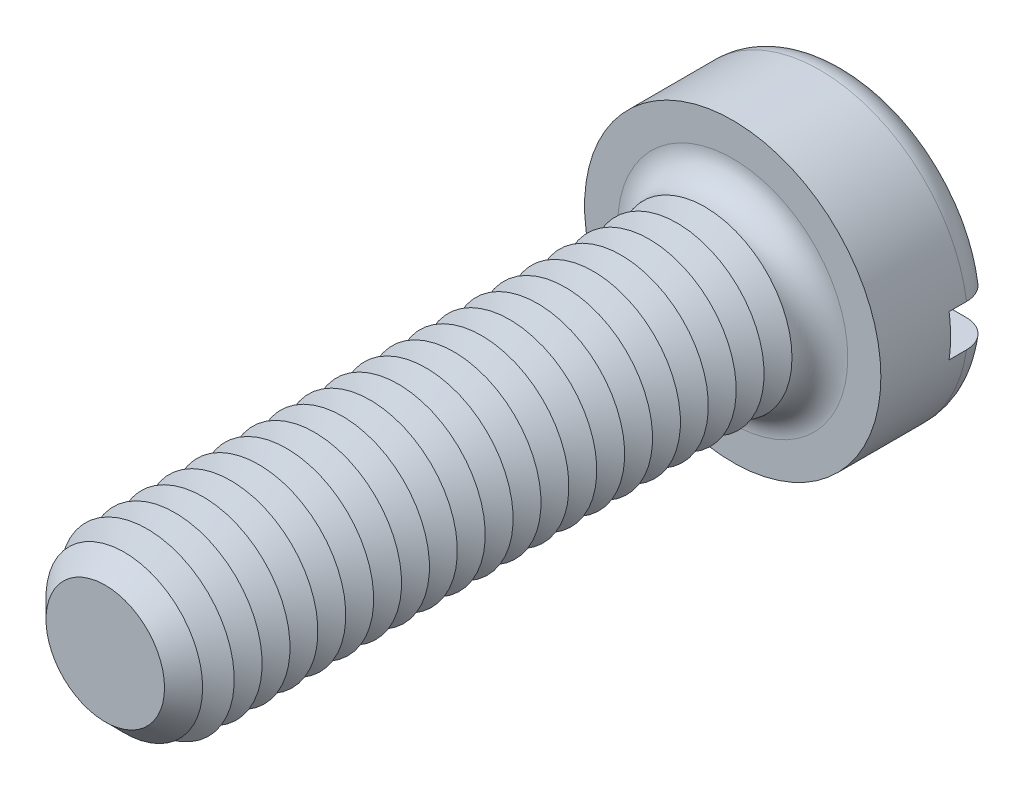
ISO-10303-21;
HEADER;
FILE_DESCRIPTION(('STEP AP214'),'2;1');
FILE_NAME('part.step','',(''),(''),'','','');
FILE_SCHEMA(('AUTOMOTIVE_DESIGN { 1 0 10303 214 1 1 1 1 }'));
ENDSEC;
DATA;
#1=APPLICATION_CONTEXT('core data for automotive mechanical design processes');
#2=APPLICATION_PROTOCOL_DEFINITION('international standard','automotive_design',2000,#1);
#3=PRODUCT_CONTEXT('',#1,'mechanical');
#4=PRODUCT('Part','Part','',(#3));
#5=PRODUCT_RELATED_PRODUCT_CATEGORY('part','',(#4));
#6=PRODUCT_DEFINITION_FORMATION('','',#4);
#7=PRODUCT_DEFINITION_CONTEXT('part definition',#1,'design');
#8=PRODUCT_DEFINITION('design','',#6,#7);
#9=PRODUCT_DEFINITION_SHAPE('','',#8);
#10=(LENGTH_UNIT() NAMED_UNIT(*) SI_UNIT(.MILLI.,.METRE.));
#11=(NAMED_UNIT(*) PLANE_ANGLE_UNIT() SI_UNIT($,.RADIAN.));
#12=(NAMED_UNIT(*) SI_UNIT($,.STERADIAN.) SOLID_ANGLE_UNIT());
#13=UNCERTAINTY_MEASURE_WITH_UNIT(LENGTH_MEASURE(1.E-05),#10,'distance_accuracy_value','');
#14=(GEOMETRIC_REPRESENTATION_CONTEXT(3) GLOBAL_UNCERTAINTY_ASSIGNED_CONTEXT((#13)) GLOBAL_UNIT_ASSIGNED_CONTEXT((#10,
#11,#12)) REPRESENTATION_CONTEXT('',''));
#15=CARTESIAN_POINT('',(0.,0.,0.));
#16=DIRECTION('',(0.,0.,1.));
#17=DIRECTION('',(1.,0.,0.));
#18=AXIS2_PLACEMENT_3D('',#15,#16,#17);
#19=CARTESIAN_POINT('',(0.,0.,-3.3));
#20=DIRECTION('',(0.,0.,1.));
#21=DIRECTION('',(1.,0.,0.));
#22=AXIS2_PLACEMENT_3D('',#19,#20,#21);
#23=PLANE('',#22);
#24=CARTESIAN_POINT('',(0.,0.,-3.3));
#25=DIRECTION('',(0.,0.,1.));
#26=DIRECTION('',(1.,0.,0.));
#27=AXIS2_PLACEMENT_3D('',#24,#25,#26);
#28=CIRCLE('',#27,3.45);
#29=CARTESIAN_POINT('',(-3.39742549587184,0.6,-3.3));
#30=VERTEX_POINT('',#29);
#31=CARTESIAN_POINT('',(3.39742549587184,0.6,-3.3));
#32=VERTEX_POINT('',#31);
#33=EDGE_CURVE('E116',#30,#32,#28,.F.);
#34=ORIENTED_EDGE('',*,*,#33,.T.);
#35=DIRECTION('',(1.,0.,0.));
#36=VECTOR('',#35,1.);
#37=CARTESIAN_POINT('',(-4.25,0.600000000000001,-3.3));
#38=LINE('',#37,#36);
#39=EDGE_CURVE('E111',#30,#32,#38,.T.);
#40=ORIENTED_EDGE('',*,*,#39,.F.);
#41=EDGE_LOOP('',(#34,#40));
#42=FACE_BOUND('',#41,.T.);
#43=ADVANCED_FACE('F39',(#42),#23,.F.);
#44=CARTESIAN_POINT('',(0.,0.,-2.5));
#45=DIRECTION('',(0.,0.,1.));
#46=DIRECTION('',(1.,0.,0.));
#47=AXIS2_PLACEMENT_3D('',#44,#45,#46);
#48=TOROIDAL_SURFACE('',#47,3.45,0.8);
#49=CARTESIAN_POINT('',(-4.06369072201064,0.600000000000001,-2.95537828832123));
#50=CARTESIAN_POINT('',(-4.03774340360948,0.600000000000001,-2.99245078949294));
#51=CARTESIAN_POINT('',(-4.00861849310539,0.600000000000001,-3.02734231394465));
#52=CARTESIAN_POINT('',(-3.94488199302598,0.600000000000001,-3.0917502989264));
#53=CARTESIAN_POINT('',(-3.91026320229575,0.600000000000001,-3.12125959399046));
#54=CARTESIAN_POINT('',(-3.83660561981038,0.600000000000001,-3.17403695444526));
#55=CARTESIAN_POINT('',(-3.79757117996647,0.6,-3.19731109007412));
#56=CARTESIAN_POINT('',(-3.71618817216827,0.6,-3.23703443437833));
#57=CARTESIAN_POINT('',(-3.67384041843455,0.6,-3.25348531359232));
#58=CARTESIAN_POINT('',(-3.58661930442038,0.6,-3.2792758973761));
#59=CARTESIAN_POINT('',(-3.54172669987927,0.6,-3.288550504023));
#60=CARTESIAN_POINT('',(-3.45102322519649,0.6,-3.29952632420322));
#61=CARTESIAN_POINT('',(-3.40521225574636,0.6,-3.30122671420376));
#62=CARTESIAN_POINT('',(-3.31340831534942,0.6,-3.29701196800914));
#63=CARTESIAN_POINT('',(-3.26741940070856,0.6,-3.29100823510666));
#64=CARTESIAN_POINT('',(-3.17708556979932,0.6,-3.27141469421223));
#65=CARTESIAN_POINT('',(-3.13274074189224,0.6,-3.25782447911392));
#66=CARTESIAN_POINT('',(-3.0466814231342,0.6,-3.22332549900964));
#67=CARTESIAN_POINT('',(-3.00498444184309,0.6,-3.20237301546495));
#68=CARTESIAN_POINT('',(-2.92572251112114,0.6,-3.15372961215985));
#69=CARTESIAN_POINT('',(-2.88815755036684,0.6,-3.12603871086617));
#70=CARTESIAN_POINT('',(-2.81847654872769,0.6,-3.06483322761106));
#71=CARTESIAN_POINT('',(-2.78633186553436,0.6,-3.03135128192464));
#72=CARTESIAN_POINT('',(-2.72824805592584,0.6,-2.95937651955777));
#73=CARTESIAN_POINT('',(-2.70230829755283,0.6,-2.92088421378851));
#74=CARTESIAN_POINT('',(-2.65791262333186,0.6,-2.84074227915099));
#75=CARTESIAN_POINT('',(-2.63932560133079,0.6,-2.79916531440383));
#76=CARTESIAN_POINT('',(-2.60958432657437,0.6,-2.7134333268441));
#77=CARTESIAN_POINT('',(-2.59842889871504,0.6,-2.66927871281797));
#78=CARTESIAN_POINT('',(-2.58411140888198,0.6,-2.58073966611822));
#79=CARTESIAN_POINT('',(-2.58077086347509,0.6,-2.5363840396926));
#80=CARTESIAN_POINT('',(-2.58167367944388,0.6,-2.44775208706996));
#81=CARTESIAN_POINT('',(-2.58591644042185,0.6,-2.40347575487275));
#82=CARTESIAN_POINT('',(-2.60175154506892,0.6,-2.31675105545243));
#83=CARTESIAN_POINT('',(-2.61326489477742,0.6,-2.27428821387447));
#84=CARTESIAN_POINT('',(-2.6431863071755,0.6,-2.19186794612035));
#85=CARTESIAN_POINT('',(-2.66159465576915,0.6,-2.15191062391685));
#86=CARTESIAN_POINT('',(-2.70494650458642,0.6,-2.07517696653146));
#87=CARTESIAN_POINT('',(-2.72995486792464,0.6,-2.03843731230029));
#88=CARTESIAN_POINT('',(-2.7856570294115,0.6,-1.96955746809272));
#89=CARTESIAN_POINT('',(-2.81635145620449,0.6,-1.93741778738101));
#90=CARTESIAN_POINT('',(-2.88329572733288,0.6,-1.87788048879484));
#91=CARTESIAN_POINT('',(-2.91965530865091,0.6,-1.85060625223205));
#92=CARTESIAN_POINT('',(-2.9963658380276,0.6,-1.80241044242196));
#93=CARTESIAN_POINT('',(-3.03671721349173,0.6,-1.78148955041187));
#94=CARTESIAN_POINT('',(-3.12111125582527,0.6,-1.74619829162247));
#95=CARTESIAN_POINT('',(-3.16521020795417,0.6,-1.73196239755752));
#96=CARTESIAN_POINT('',(-3.25516487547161,0.6,-1.71103773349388));
#97=CARTESIAN_POINT('',(-3.30102068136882,0.6,-1.70434935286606));
#98=CARTESIAN_POINT('',(-3.39352689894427,0.6,-1.69870104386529));
#99=CARTESIAN_POINT('',(-3.44018061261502,0.6,-1.69979487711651));
#100=CARTESIAN_POINT('',(-3.53263583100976,0.6,-1.70983959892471));
#101=CARTESIAN_POINT('',(-3.57843734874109,0.6,-1.71879036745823));
#102=CARTESIAN_POINT('',(-3.66763544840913,0.6,-1.74426972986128));
#103=CARTESIAN_POINT('',(-3.71104292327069,0.6,-1.76076015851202));
#104=CARTESIAN_POINT('',(-3.79442616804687,0.6,-1.80087686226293));
#105=CARTESIAN_POINT('',(-3.83440212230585,0.600000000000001,-1.82450275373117));
#106=CARTESIAN_POINT('',(-3.90929765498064,0.600000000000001,-1.87793548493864));
#107=CARTESIAN_POINT('',(-3.94426963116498,0.600000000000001,-1.90766887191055));
#108=CARTESIAN_POINT('',(-4.00864839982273,0.600000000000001,-1.9726503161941));
#109=CARTESIAN_POINT('',(-4.03805555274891,0.600000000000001,-2.00789801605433));
#110=CARTESIAN_POINT('',(-4.09009460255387,0.600000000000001,-2.08244463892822));
#111=CARTESIAN_POINT('',(-4.11280448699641,0.600000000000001,-2.12168912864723));
#112=CARTESIAN_POINT('',(-4.15124086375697,0.600000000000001,-2.2034588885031));
#113=CARTESIAN_POINT('',(-4.16696802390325,0.600000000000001,-2.24598384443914));
#114=CARTESIAN_POINT('',(-4.19085131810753,0.600000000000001,-2.33267862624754));
#115=CARTESIAN_POINT('',(-4.19907708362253,0.600000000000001,-2.37682928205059));
#116=CARTESIAN_POINT('',(-4.2079638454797,0.600000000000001,-2.46589754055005));
#117=CARTESIAN_POINT('',(-4.20862315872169,0.600000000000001,-2.51081531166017));
#118=CARTESIAN_POINT('',(-4.20236829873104,0.600000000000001,-2.59993343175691));
#119=CARTESIAN_POINT('',(-4.19548454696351,0.600000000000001,-2.64413593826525));
#120=CARTESIAN_POINT('',(-4.17439924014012,0.600000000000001,-2.73071930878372));
#121=CARTESIAN_POINT('',(-4.16020675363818,0.600000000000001,-2.77310235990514));
#122=CARTESIAN_POINT('',(-4.1318825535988,0.600000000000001,-2.83880495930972));
#123=CARTESIAN_POINT('',(-4.11991183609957,0.600000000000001,-2.86307959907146));
#124=CARTESIAN_POINT('',(-4.09356927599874,0.600000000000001,-2.91028856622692));
#125=CARTESIAN_POINT('',(-4.07919744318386,0.600000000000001,-2.9332228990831));
#126=CARTESIAN_POINT('',(-4.06369072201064,0.600000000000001,-2.95537828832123));
#127=B_SPLINE_CURVE_WITH_KNOTS('',3,(#49,#50,#51,#52,#53,#54,#55,#56,#57,#58,#59,#60,#61,#62,
#63,#64,#65,#66,#67,#68,#69,#70,#71,#72,#73,#74,#75,#76,#77,#78,#79,#80,#81,#82,#83,#84,#85,#86,
#87,#88,#89,#90,#91,#92,#93,#94,#95,#96,#97,#98,#99,#100,#101,#102,#103,#104,#105,#106,#107,
#108,#109,#110,#111,#112,#113,#114,#115,#116,#117,#118,#119,#120,#121,#122,#123,#124,#125,#126),
.UNSPECIFIED.,.T.,.F.,(4,2,2,2,2,2,2,2,2,2,2,2,2,2,2,2,2,2,2,2,2,2,2,2,2,2,2,2,2,2,2,2,2,2,2,2,
2,2,4),(0.,0.13565225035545,0.271483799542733,0.407182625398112,0.542848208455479,
0.679730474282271,0.816627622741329,0.955113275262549,1.09360635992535,1.23293614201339,
1.37226554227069,1.51083389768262,1.64938813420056,1.78534653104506,1.92128342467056,
2.0540840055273,2.18687407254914,2.31824564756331,2.44962267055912,2.58234229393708,
2.71507659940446,2.85080630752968,2.98655056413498,3.12491938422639,3.26329534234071,
3.40262816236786,3.54195885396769,3.68059194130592,3.81921757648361,3.95626453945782,
4.09330262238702,4.2286754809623,4.36403538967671,4.49812564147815,4.63224572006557,
4.76582687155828,4.89924267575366,4.98031194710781,5.0613808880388),.UNSPECIFIED.);
#128=CARTESIAN_POINT('',(-4.20743389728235,0.600000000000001,-2.50000000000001));
#129=VERTEX_POINT('',#128);
#130=EDGE_CURVE('E353',#129,#30,#127,.T.);
#131=ORIENTED_EDGE('',*,*,#130,.F.);
#132=CARTESIAN_POINT('',(0.,0.,-2.5));
#133=DIRECTION('',(0.,0.,1.));
#134=DIRECTION('',(1.,0.,0.));
#135=AXIS2_PLACEMENT_3D('',#132,#133,#134);
#136=CIRCLE('',#135,4.25);
#137=CARTESIAN_POINT('',(4.20743389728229,0.599999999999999,-2.5));
#138=VERTEX_POINT('',#137);
#139=EDGE_CURVE('E125',#138,#129,#136,.T.);
#140=ORIENTED_EDGE('',*,*,#139,.F.);
#141=CARTESIAN_POINT('',(2.63947327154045,0.6,-2.79608831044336));
#142=CARTESIAN_POINT('',(2.65655980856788,0.6,-2.83790320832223));
#143=CARTESIAN_POINT('',(2.67725642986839,0.6,-2.87828303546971));
#144=CARTESIAN_POINT('',(2.72519250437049,0.6,-2.95500233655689));
#145=CARTESIAN_POINT('',(2.75244152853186,0.6,-2.9913357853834));
#146=CARTESIAN_POINT('',(2.81257938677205,0.6,-3.05889430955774));
#147=CARTESIAN_POINT('',(2.84545995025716,0.6,-3.09012674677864));
#148=CARTESIAN_POINT('',(2.91591143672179,0.6,-3.14672620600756));
#149=CARTESIAN_POINT('',(2.95348119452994,0.6,-3.17209468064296));
#150=CARTESIAN_POINT('',(3.03291143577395,0.6,-3.21669611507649));
#151=CARTESIAN_POINT('',(3.07483186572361,0.6,-3.23582234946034));
#152=CARTESIAN_POINT('',(3.16126659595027,0.6,-3.26686062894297));
#153=CARTESIAN_POINT('',(3.2057811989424,0.6,-3.27877183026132));
#154=CARTESIAN_POINT('',(3.29669878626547,0.6,-3.29514603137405));
#155=CARTESIAN_POINT('',(3.34311773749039,0.6,-3.29952056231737));
#156=CARTESIAN_POINT('',(3.43603189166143,0.6,-3.30040472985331));
#157=CARTESIAN_POINT('',(3.48252709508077,0.6,-3.29691431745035));
#158=CARTESIAN_POINT('',(3.57420049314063,0.6,-3.28214240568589));
#159=CARTESIAN_POINT('',(3.61938038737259,0.6,-3.27087147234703));
#160=CARTESIAN_POINT('',(3.70717477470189,0.6,-3.24082890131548));
#161=CARTESIAN_POINT('',(3.74978938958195,0.6,-3.22205762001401));
#162=CARTESIAN_POINT('',(3.83078828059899,0.6,-3.17773607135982));
#163=CARTESIAN_POINT('',(3.86921015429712,0.599999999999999,-3.15225453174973));
#164=CARTESIAN_POINT('',(3.94116038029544,0.599999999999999,-3.09512672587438));
#165=CARTESIAN_POINT('',(3.9746890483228,0.599999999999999,-3.06348085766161));
#166=CARTESIAN_POINT('',(4.03545911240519,0.599999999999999,-2.99534640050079));
#167=CARTESIAN_POINT('',(4.06277344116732,0.599999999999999,-2.95892285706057));
#168=CARTESIAN_POINT('',(4.11082191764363,0.599999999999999,-2.88196698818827));
#169=CARTESIAN_POINT('',(4.13155647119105,0.599999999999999,-2.84143491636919));
#170=CARTESIAN_POINT('',(4.16563480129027,0.599999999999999,-2.75787550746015));
#171=CARTESIAN_POINT('',(4.1790544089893,0.599999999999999,-2.71487908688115));
#172=CARTESIAN_POINT('',(4.19843340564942,0.599999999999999,-2.62723691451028));
#173=CARTESIAN_POINT('',(4.20439310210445,0.599999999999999,-2.58259123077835));
#174=CARTESIAN_POINT('',(4.2086595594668,0.599999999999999,-2.49321831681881));
#175=CARTESIAN_POINT('',(4.20701422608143,0.599999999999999,-2.4484933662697));
#176=CARTESIAN_POINT('',(4.1962295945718,0.599999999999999,-2.35995704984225));
#177=CARTESIAN_POINT('',(4.18709040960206,0.599999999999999,-2.31614567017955));
#178=CARTESIAN_POINT('',(4.16160290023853,0.599999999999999,-2.23072100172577));
#179=CARTESIAN_POINT('',(4.14526169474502,0.599999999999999,-2.18910558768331));
#180=CARTESIAN_POINT('',(4.10585410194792,0.599999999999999,-2.10919238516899));
#181=CARTESIAN_POINT('',(4.08278762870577,0.599999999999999,-2.07089463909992));
#182=CARTESIAN_POINT('',(4.030487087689,0.599999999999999,-1.99851484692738));
#183=CARTESIAN_POINT('',(4.00122628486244,0.599999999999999,-1.9644521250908));
#184=CARTESIAN_POINT('',(3.93744772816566,0.599999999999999,-1.90166877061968));
#185=CARTESIAN_POINT('',(3.90292977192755,0.599999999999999,-1.87294834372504));
#186=CARTESIAN_POINT('',(3.82928727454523,0.599999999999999,-1.82137853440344));
#187=CARTESIAN_POINT('',(3.79012374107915,0.6,-1.79858484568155));
#188=CARTESIAN_POINT('',(3.70856025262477,0.6,-1.75980712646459));
#189=CARTESIAN_POINT('',(3.66616010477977,0.6,-1.74382350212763));
#190=CARTESIAN_POINT('',(3.57878495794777,0.6,-1.71891499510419));
#191=CARTESIAN_POINT('',(3.53378519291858,0.6,-1.71007699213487));
#192=CARTESIAN_POINT('',(3.44294322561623,0.6,-1.69998722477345));
#193=CARTESIAN_POINT('',(3.3971009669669,0.6,-1.69873596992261));
#194=CARTESIAN_POINT('',(3.30531297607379,0.6,-1.70385439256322));
#195=CARTESIAN_POINT('',(3.25937213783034,0.6,-1.71031204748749));
#196=CARTESIAN_POINT('',(3.1692099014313,0.6,-1.73080107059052));
#197=CARTESIAN_POINT('',(3.12498860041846,0.6,-1.74483286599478));
#198=CARTESIAN_POINT('',(3.03926209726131,0.6,-1.78018941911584));
#199=CARTESIAN_POINT('',(2.99777407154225,0.6,-1.80155586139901));
#200=CARTESIAN_POINT('',(2.91899881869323,0.6,-1.85098881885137));
#201=CARTESIAN_POINT('',(2.88171158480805,0.6,-1.8790553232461));
#202=CARTESIAN_POINT('',(2.81266124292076,0.6,-1.94094884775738));
#203=CARTESIAN_POINT('',(2.78086710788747,0.6,-1.97474122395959));
#204=CARTESIAN_POINT('',(2.72353615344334,0.6,-2.0472724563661));
#205=CARTESIAN_POINT('',(2.69799841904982,0.6,-2.08601058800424));
#206=CARTESIAN_POINT('',(2.65444718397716,0.6,-2.16655019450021));
#207=CARTESIAN_POINT('',(2.63629889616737,0.6,-2.20827875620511));
#208=CARTESIAN_POINT('',(2.60744942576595,0.6,-2.29424821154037));
#209=CARTESIAN_POINT('',(2.59674901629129,0.6,-2.33848936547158));
#210=CARTESIAN_POINT('',(2.5833312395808,0.6,-2.42714258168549));
#211=CARTESIAN_POINT('',(2.58043995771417,0.6,-2.47152848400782));
#212=CARTESIAN_POINT('',(2.58224493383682,0.6,-2.56010574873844));
#213=CARTESIAN_POINT('',(2.58693104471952,0.6,-2.60429729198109));
#214=CARTESIAN_POINT('',(2.60020046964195,0.6,-2.67311978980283));
#215=CARTESIAN_POINT('',(2.60635343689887,0.6,-2.69824441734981));
#216=CARTESIAN_POINT('',(2.62110140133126,0.6,-2.74776540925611));
#217=CARTESIAN_POINT('',(2.62969634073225,0.6,-2.77216179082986));
#218=CARTESIAN_POINT('',(2.63947327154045,0.6,-2.79608831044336));
#219=B_SPLINE_CURVE_WITH_KNOTS('',3,(#141,#142,#143,#144,#145,#146,#147,#148,#149,#150,#151,
#152,#153,#154,#155,#156,#157,#158,#159,#160,#161,#162,#163,#164,#165,#166,#167,#168,#169,#170,
#171,#172,#173,#174,#175,#176,#177,#178,#179,#180,#181,#182,#183,#184,#185,#186,#187,#188,#189,
#190,#191,#192,#193,#194,#195,#196,#197,#198,#199,#200,#201,#202,#203,#204,#205,#206,#207,#208,
#209,#210,#211,#212,#213,#214,#215,#216,#217,#218),.UNSPECIFIED.,.T.,.F.,(4,2,2,2,2,2,2,2,2,2,2,
2,2,2,2,2,2,2,2,2,2,2,2,2,2,2,2,2,2,2,2,2,2,2,2,2,2,2,4),(0.,0.135416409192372,
0.271031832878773,0.406449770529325,0.541834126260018,0.679424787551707,0.817031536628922,
0.956242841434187,1.09545501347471,1.23447850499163,1.37349539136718,1.51114036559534,
1.64877645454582,1.78470267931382,1.92062051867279,2.05510117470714,2.1895762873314,
2.32320547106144,2.45683263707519,2.59032801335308,2.72382509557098,2.85791055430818,
2.99200117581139,3.12730969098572,3.26262627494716,3.39956435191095,3.53651162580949,
3.67503685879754,3.81356990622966,3.95290367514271,4.09223721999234,4.23075602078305,
4.36925455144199,4.50509949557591,4.6409585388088,4.77376594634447,4.90639565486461,
4.98388287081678,5.06136825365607),.UNSPECIFIED.);
#220=EDGE_CURVE('E355',#32,#138,#219,.T.);
#221=ORIENTED_EDGE('',*,*,#220,.F.);
#222=ORIENTED_EDGE('',*,*,#33,.F.);
#223=EDGE_LOOP('',(#131,#140,#221,#222));
#224=FACE_BOUND('',#223,.T.);
#225=ADVANCED_FACE('F337',(#224),#48,.T.);
#226=CARTESIAN_POINT('',(0.,0.,-3.3));
#227=DIRECTION('',(0.,0.,1.));
#228=DIRECTION('',(1.,0.,0.));
#229=AXIS2_PLACEMENT_3D('',#226,#227,#228);
#230=CYLINDRICAL_SURFACE('',#229,4.25);
#231=DIRECTION('',(0.,0.,1.));
#232=VECTOR('',#231,1.);
#233=CARTESIAN_POINT('',(4.20743389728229,0.599999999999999,-3.3));
#234=LINE('',#233,#232);
#235=CARTESIAN_POINT('',(4.20743389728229,0.599999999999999,-2.));
#236=VERTEX_POINT('',#235);
#237=EDGE_CURVE('E371',#138,#236,#234,.T.);
#238=ORIENTED_EDGE('',*,*,#237,.F.);
#239=ORIENTED_EDGE('',*,*,#139,.T.);
#240=DIRECTION('',(0.,0.,1.));
#241=VECTOR('',#240,1.);
#242=CARTESIAN_POINT('',(-4.20743389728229,0.600000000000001,-3.3));
#243=LINE('',#242,#241);
#244=CARTESIAN_POINT('',(-4.20743389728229,0.600000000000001,-2.));
#245=VERTEX_POINT('',#244);
#246=EDGE_CURVE('E63',#245,#129,#243,.F.);
#247=ORIENTED_EDGE('',*,*,#246,.F.);
#248=CARTESIAN_POINT('',(0.,0.,-2.));
#249=DIRECTION('',(0.,0.,-1.));
#250=DIRECTION('',(-1.,0.,0.));
#251=AXIS2_PLACEMENT_3D('',#248,#249,#250);
#252=CIRCLE('',#251,4.25);
#253=CARTESIAN_POINT('',(-4.20743389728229,-0.599999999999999,-2.));
#254=VERTEX_POINT('',#253);
#255=EDGE_CURVE('E43',#245,#254,#252,.F.);
#256=ORIENTED_EDGE('',*,*,#255,.T.);
#257=DIRECTION('',(0.,0.,1.));
#258=VECTOR('',#257,1.);
#259=CARTESIAN_POINT('',(-4.20743389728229,-0.599999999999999,-3.3));
#260=LINE('',#259,#258);
#261=CARTESIAN_POINT('',(-4.20743389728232,-0.599999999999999,-2.5));
#262=VERTEX_POINT('',#261);
#263=EDGE_CURVE('E368',#262,#254,#260,.T.);
#264=ORIENTED_EDGE('',*,*,#263,.F.);
#265=CARTESIAN_POINT('',(4.20743389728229,-0.600000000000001,-2.5));
#266=VERTEX_POINT('',#265);
#267=EDGE_CURVE('E127',#262,#266,#136,.T.);
#268=ORIENTED_EDGE('',*,*,#267,.T.);
#269=DIRECTION('',(0.,0.,1.));
#270=VECTOR('',#269,1.);
#271=CARTESIAN_POINT('',(4.20743389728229,-0.600000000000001,-3.3));
#272=LINE('',#271,#270);
#273=CARTESIAN_POINT('',(4.20743389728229,-0.600000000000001,-2.));
#274=VERTEX_POINT('',#273);
#275=EDGE_CURVE('E55',#274,#266,#272,.F.);
#276=ORIENTED_EDGE('',*,*,#275,.F.);
#277=EDGE_CURVE('E11',#274,#236,#252,.F.);
#278=ORIENTED_EDGE('',*,*,#277,.T.);
#279=EDGE_LOOP('',(#238,#239,#247,#256,#264,#268,#276,#278));
#280=FACE_BOUND('',#279,.T.);
#281=CARTESIAN_POINT('',(0.,0.,0.));
#282=DIRECTION('',(0.,0.,1.));
#283=DIRECTION('',(1.,0.,0.));
#284=AXIS2_PLACEMENT_3D('',#281,#282,#283);
#285=CIRCLE('',#284,4.25);
#286=CARTESIAN_POINT('',(4.25,0.,0.));
#287=VERTEX_POINT('',#286);
#288=EDGE_CURVE('E374',#287,#287,#285,.T.);
#289=ORIENTED_EDGE('',*,*,#288,.F.);
#290=EDGE_LOOP('',(#289));
#291=FACE_BOUND('',#290,.T.);
#292=ADVANCED_FACE('F333',(#280,#291),#230,.T.);
#293=CARTESIAN_POINT('',(3.39742549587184,-0.6,-3.3));
#294=VERTEX_POINT('',#293);
#295=CARTESIAN_POINT('',(-3.39742549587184,-0.6,-3.3));
#296=VERTEX_POINT('',#295);
#297=EDGE_CURVE('E109',#294,#296,#28,.F.);
#298=ORIENTED_EDGE('',*,*,#297,.T.);
#299=DIRECTION('',(-1.,0.,0.));
#300=VECTOR('',#299,1.);
#301=CARTESIAN_POINT('',(-4.25,-0.599999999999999,-3.3));
#302=LINE('',#301,#300);
#303=EDGE_CURVE('E96',#294,#296,#302,.T.);
#304=ORIENTED_EDGE('',*,*,#303,.F.);
#305=EDGE_LOOP('',(#298,#304));
#306=FACE_BOUND('',#305,.T.);
#307=ADVANCED_FACE('F108',(#306),#23,.F.);
#308=CARTESIAN_POINT('',(0.,0.,0.));
#309=DIRECTION('',(0.,0.,1.));
#310=DIRECTION('',(1.,0.,0.));
#311=AXIS2_PLACEMENT_3D('',#308,#309,#310);
#312=PLANE('',#311);
#313=CARTESIAN_POINT('',(0.,0.,0.));
#314=DIRECTION('',(0.,0.,1.));
#315=DIRECTION('',(1.,0.,0.));
#316=AXIS2_PLACEMENT_3D('',#313,#314,#315);
#317=CIRCLE('',#316,3.3);
#318=CARTESIAN_POINT('',(3.3,0.,0.));
#319=VERTEX_POINT('',#318);
#320=EDGE_CURVE('E115',#319,#319,#317,.F.);
#321=ORIENTED_EDGE('',*,*,#320,.T.);
#322=EDGE_LOOP('',(#321));
#323=FACE_BOUND('',#322,.T.);
#324=ORIENTED_EDGE('',*,*,#288,.T.);
#325=EDGE_LOOP('',(#324));
#326=FACE_BOUND('',#325,.T.);
#327=ADVANCED_FACE('F332',(#323,#326),#312,.T.);
#328=CARTESIAN_POINT('',(-4.06369072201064,-0.599999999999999,-2.95537828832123));
#329=CARTESIAN_POINT('',(-4.08928577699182,-0.599999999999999,-2.91880204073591));
#330=CARTESIAN_POINT('',(-4.11182555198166,-0.599999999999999,-2.88005030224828));
#331=CARTESIAN_POINT('',(-4.15010404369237,-0.599999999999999,-2.79928452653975));
#332=CARTESIAN_POINT('',(-4.16583526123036,-0.599999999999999,-2.75726695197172));
#333=CARTESIAN_POINT('',(-4.19000286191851,-0.599999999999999,-2.67118996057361));
#334=CARTESIAN_POINT('',(-4.19844101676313,-0.599999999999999,-2.62713104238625));
#335=CARTESIAN_POINT('',(-4.20777174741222,-0.599999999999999,-2.53823222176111));
#336=CARTESIAN_POINT('',(-4.20866608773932,-0.599999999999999,-2.49339250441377));
#337=CARTESIAN_POINT('',(-4.20289683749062,-0.599999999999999,-2.40433856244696));
#338=CARTESIAN_POINT('',(-4.19625607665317,-0.599999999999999,-2.36012285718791));
#339=CARTESIAN_POINT('',(-4.17565084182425,-0.599999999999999,-2.27343166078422));
#340=CARTESIAN_POINT('',(-4.16168615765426,-0.599999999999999,-2.23095621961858));
#341=CARTESIAN_POINT('',(-4.12683188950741,-0.599999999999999,-2.14890863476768));
#342=CARTESIAN_POINT('',(-4.10593663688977,-0.599999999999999,-2.10933890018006));
#343=CARTESIAN_POINT('',(-4.05783763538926,-0.599999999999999,-2.03424145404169));
#344=CARTESIAN_POINT('',(-4.03063375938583,-0.599999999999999,-1.99871382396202));
#345=CARTESIAN_POINT('',(-3.97052236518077,-0.599999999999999,-1.93246905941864));
#346=CARTESIAN_POINT('',(-3.93758114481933,-0.599999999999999,-1.90178251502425));
#347=CARTESIAN_POINT('',(-3.86706007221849,-0.599999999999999,-1.84630837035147));
#348=CARTESIAN_POINT('',(-3.82948001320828,-0.6,-1.82152103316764));
#349=CARTESIAN_POINT('',(-3.75033766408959,-0.6,-1.77826995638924));
#350=CARTESIAN_POINT('',(-3.70873831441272,-0.6,-1.7598740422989));
#351=CARTESIAN_POINT('',(-3.62306661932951,-0.6,-1.73023196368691));
#352=CARTESIAN_POINT('',(-3.57899411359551,-0.6,-1.71898626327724));
#353=CARTESIAN_POINT('',(-3.48904845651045,-0.6,-1.70382025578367));
#354=CARTESIAN_POINT('',(-3.44315982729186,-0.6,-1.69999172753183));
#355=CARTESIAN_POINT('',(-3.35138360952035,-0.6,-1.7000083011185));
#356=CARTESIAN_POINT('',(-3.30549602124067,-0.6,-1.70385391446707));
#357=CARTESIAN_POINT('',(-3.21452492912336,-0.6,-1.71917227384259));
#358=CARTESIAN_POINT('',(-3.16945455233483,-0.6,-1.73072307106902));
#359=CARTESIAN_POINT('',(-3.08188104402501,-0.6,-1.76120640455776));
#360=CARTESIAN_POINT('',(-3.0393780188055,-0.6,-1.78013924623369));
#361=CARTESIAN_POINT('',(-2.95805296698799,-0.6,-1.82493384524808));
#362=CARTESIAN_POINT('',(-2.9192403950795,-0.6,-1.85081278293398));
#363=CARTESIAN_POINT('',(-2.84656695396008,-0.6,-1.90878317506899));
#364=CARTESIAN_POINT('',(-2.81270591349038,-0.6,-1.94087441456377));
#365=CARTESIAN_POINT('',(-2.75131050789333,-0.6,-2.01002500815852));
#366=CARTESIAN_POINT('',(-2.72371339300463,-0.6,-2.04702860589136));
#367=CARTESIAN_POINT('',(-2.67528742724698,-0.6,-2.12522869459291));
#368=CARTESIAN_POINT('',(-2.65445765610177,-0.6,-2.1664246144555));
#369=CARTESIAN_POINT('',(-2.62065354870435,-0.6,-2.25087266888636));
#370=CARTESIAN_POINT('',(-2.60751663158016,-0.6,-2.29405971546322));
#371=CARTESIAN_POINT('',(-2.58885106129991,-0.6,-2.38204659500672));
#372=CARTESIAN_POINT('',(-2.58332131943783,-0.6,-2.42684619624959));
#373=CARTESIAN_POINT('',(-2.58009777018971,-0.6,-2.51580379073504));
#374=CARTESIAN_POINT('',(-2.58224575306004,-0.6,-2.55995612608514));
#375=CARTESIAN_POINT('',(-2.59395205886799,-0.6,-2.64726495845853));
#376=CARTESIAN_POINT('',(-2.60351013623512,-0.6,-2.69042148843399));
#377=CARTESIAN_POINT('',(-2.62967159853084,-0.6,-2.77438771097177));
#378=CARTESIAN_POINT('',(-2.64625243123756,-0.6,-2.81520444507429));
#379=CARTESIAN_POINT('',(-2.68592348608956,-0.6,-2.89353901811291));
#380=CARTESIAN_POINT('',(-2.70901418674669,-0.6,-2.9310566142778));
#381=CARTESIAN_POINT('',(-2.7614318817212,-0.6,-3.00240040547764));
#382=CARTESIAN_POINT('',(-2.79085487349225,-0.6,-3.03615603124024));
#383=CARTESIAN_POINT('',(-2.85483456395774,-0.6,-3.09838834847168));
#384=CARTESIAN_POINT('',(-2.88939187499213,-0.6,-3.12686440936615));
#385=CARTESIAN_POINT('',(-2.96351967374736,-0.6,-3.17841283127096));
#386=CARTESIAN_POINT('',(-3.00318741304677,-0.6,-3.20134539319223));
#387=CARTESIAN_POINT('',(-3.08576649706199,-0.6,-3.24034364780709));
#388=CARTESIAN_POINT('',(-3.12867814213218,-0.6,-3.25640870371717));
#389=CARTESIAN_POINT('',(-3.21724048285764,-0.6,-3.28143816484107));
#390=CARTESIAN_POINT('',(-3.26292314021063,-0.6,-3.29028963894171));
#391=CARTESIAN_POINT('',(-3.35512527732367,-0.6,-3.30021681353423));
#392=CARTESIAN_POINT('',(-3.40164474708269,-0.6,-3.30129260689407));
#393=CARTESIAN_POINT('',(-3.49429978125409,-0.6,-3.29560589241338));
#394=CARTESIAN_POINT('',(-3.54043436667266,-0.6,-3.28882735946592));
#395=CARTESIAN_POINT('',(-3.63090382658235,-0.6,-3.26755492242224));
#396=CARTESIAN_POINT('',(-3.67523831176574,-0.6,-3.25305935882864));
#397=CARTESIAN_POINT('',(-3.76046509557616,-0.6,-3.21686867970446));
#398=CARTESIAN_POINT('',(-3.80138087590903,-0.599999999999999,-3.1952288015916));
#399=CARTESIAN_POINT('',(-3.8788986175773,-0.599999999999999,-3.14531817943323));
#400=CARTESIAN_POINT('',(-3.91550599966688,-0.599999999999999,-3.11705590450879));
#401=CARTESIAN_POINT('',(-3.97074313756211,-0.599999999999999,-3.06628809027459));
#402=CARTESIAN_POINT('',(-3.99100743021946,-0.599999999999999,-3.04553102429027));
#403=CARTESIAN_POINT('',(-4.02917385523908,-0.599999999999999,-3.00194762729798));
#404=CARTESIAN_POINT('',(-4.04707600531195,-0.599999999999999,-2.97912131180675));
#405=CARTESIAN_POINT('',(-4.06369072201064,-0.599999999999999,-2.95537828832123));
#406=B_SPLINE_CURVE_WITH_KNOTS('',3,(#328,#329,#330,#331,#332,#333,#334,#335,#336,#337,#338,
#339,#340,#341,#342,#343,#344,#345,#346,#347,#348,#349,#350,#351,#352,#353,#354,#355,#356,#357,
#358,#359,#360,#361,#362,#363,#364,#365,#366,#367,#368,#369,#370,#371,#372,#373,#374,#375,#376,
#377,#378,#379,#380,#381,#382,#383,#384,#385,#386,#387,#388,#389,#390,#391,#392,#393,#394,#395,
#396,#397,#398,#399,#400,#401,#402,#403,#404,#405),.UNSPECIFIED.,.T.,.F.,(4,2,2,2,2,2,2,2,2,2,2,
2,2,2,2,2,2,2,2,2,2,2,2,2,2,2,2,2,2,2,2,2,2,2,2,2,2,2,4),(0.,0.133821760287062,
0.267790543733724,0.401726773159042,0.535631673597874,0.669131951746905,0.802636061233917,
0.936249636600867,1.06986590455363,1.2042952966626,1.3387306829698,1.47455198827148,
1.61038210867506,1.74788249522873,1.88539204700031,2.02431612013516,2.16324594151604,
2.30252260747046,2.4417944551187,2.57960263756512,2.71739207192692,2.85215325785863,
2.98689515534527,3.11887666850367,3.25085380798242,3.38241030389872,3.51397647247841,
3.64769871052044,3.78143690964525,3.91826005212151,4.05509587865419,4.19403485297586,
4.33297216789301,4.47219345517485,4.61144469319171,4.74964356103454,4.887666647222,
4.97453605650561,5.06140481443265),.UNSPECIFIED.);
#407=EDGE_CURVE('E103',#296,#262,#406,.T.);
#408=ORIENTED_EDGE('',*,*,#407,.F.);
#409=ORIENTED_EDGE('',*,*,#297,.F.);
#410=CARTESIAN_POINT('',(2.63947327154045,-0.6,-2.79608831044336));
#411=CARTESIAN_POINT('',(2.62285766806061,-0.6,-2.75541510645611));
#412=CARTESIAN_POINT('',(2.60963282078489,-0.6,-2.71332585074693));
#413=CARTESIAN_POINT('',(2.59042394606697,-0.6,-2.62749460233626));
#414=CARTESIAN_POINT('',(2.58444686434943,-0.6,-2.58375106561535));
#415=CARTESIAN_POINT('',(2.57995287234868,-0.6,-2.49588524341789));
#416=CARTESIAN_POINT('',(2.58143477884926,-0.6,-2.45176301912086));
#417=CARTESIAN_POINT('',(2.59180622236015,-0.6,-2.36440906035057));
#418=CARTESIAN_POINT('',(2.60069434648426,-0.6,-2.32117715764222));
#419=CARTESIAN_POINT('',(2.62554964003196,-0.6,-2.23689909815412));
#420=CARTESIAN_POINT('',(2.6415022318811,-0.6,-2.19584863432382));
#421=CARTESIAN_POINT('',(2.67996913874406,-0.6,-2.11694797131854));
#422=CARTESIAN_POINT('',(2.70248409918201,-0.6,-2.07909808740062));
#423=CARTESIAN_POINT('',(2.75378972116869,-0.6,-2.00702296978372));
#424=CARTESIAN_POINT('',(2.7826732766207,-0.6,-1.97286389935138));
#425=CARTESIAN_POINT('',(2.84564717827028,-0.6,-1.90974167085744));
#426=CARTESIAN_POINT('',(2.87973812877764,-0.6,-1.88077911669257));
#427=CARTESIAN_POINT('',(2.95300941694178,-0.6,-1.82817307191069));
#428=CARTESIAN_POINT('',(2.99228920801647,-0.6,-1.8046680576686));
#429=CARTESIAN_POINT('',(3.07419050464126,-0.6,-1.76446470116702));
#430=CARTESIAN_POINT('',(3.11681231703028,-0.6,-1.74776698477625));
#431=CARTESIAN_POINT('',(3.20492149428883,-0.6,-1.72140945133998));
#432=CARTESIAN_POINT('',(3.25044365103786,-0.6,-1.71186578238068));
#433=CARTESIAN_POINT('',(3.34244451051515,-0.6,-1.70053183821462));
#434=CARTESIAN_POINT('',(3.38892324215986,-0.6,-1.69874179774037));
#435=CARTESIAN_POINT('',(3.48165030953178,-0.6,-1.70299737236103));
#436=CARTESIAN_POINT('',(3.52789766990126,-0.6,-1.70906439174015));
#437=CARTESIAN_POINT('',(3.61869999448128,-0.6,-1.72893768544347));
#438=CARTESIAN_POINT('',(3.6632550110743,-0.6,-1.742743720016));
#439=CARTESIAN_POINT('',(3.7490339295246,-0.6,-1.77760539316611));
#440=CARTESIAN_POINT('',(3.79028083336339,-0.600000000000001,-1.79860440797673));
#441=CARTESIAN_POINT('',(3.86860401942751,-0.600000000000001,-1.84731105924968));
#442=CARTESIAN_POINT('',(3.90568056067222,-0.600000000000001,-1.87501827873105));
#443=CARTESIAN_POINT('',(3.97412845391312,-0.600000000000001,-1.93599408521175));
#444=CARTESIAN_POINT('',(4.00556369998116,-0.600000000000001,-1.96919094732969));
#445=CARTESIAN_POINT('',(4.06233546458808,-0.600000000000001,-2.0404445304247));
#446=CARTESIAN_POINT('',(4.08767237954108,-0.600000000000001,-2.07850093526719));
#447=CARTESIAN_POINT('',(4.13122502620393,-0.600000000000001,-2.15791791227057));
#448=CARTESIAN_POINT('',(4.14951966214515,-0.600000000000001,-2.19923522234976));
#449=CARTESIAN_POINT('',(4.17884974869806,-0.600000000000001,-2.28437065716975));
#450=CARTESIAN_POINT('',(4.18988555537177,-0.600000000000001,-2.32818865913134));
#451=CARTESIAN_POINT('',(4.20430724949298,-0.600000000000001,-2.41670951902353));
#452=CARTESIAN_POINT('',(4.2077528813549,-0.600000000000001,-2.46140265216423));
#453=CARTESIAN_POINT('',(4.20706844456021,-0.600000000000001,-2.55073028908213));
#454=CARTESIAN_POINT('',(4.20293856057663,-0.600000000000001,-2.595364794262));
#455=CARTESIAN_POINT('',(4.18724926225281,-0.600000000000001,-2.68317733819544));
#456=CARTESIAN_POINT('',(4.17571081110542,-0.600000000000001,-2.72635912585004));
#457=CARTESIAN_POINT('',(4.14556645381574,-0.600000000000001,-2.81017999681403));
#458=CARTESIAN_POINT('',(4.12696052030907,-0.600000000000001,-2.85081907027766));
#459=CARTESIAN_POINT('',(4.08317014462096,-0.600000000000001,-2.92852328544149));
#460=CARTESIAN_POINT('',(4.0579684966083,-0.600000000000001,-2.96557872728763));
#461=CARTESIAN_POINT('',(4.00174565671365,-0.600000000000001,-3.034972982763));
#462=CARTESIAN_POINT('',(3.97072429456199,-0.600000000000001,-3.06731165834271));
#463=CARTESIAN_POINT('',(3.90349659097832,-0.600000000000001,-3.12662735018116));
#464=CARTESIAN_POINT('',(3.86725240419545,-0.600000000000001,-3.15356146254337));
#465=CARTESIAN_POINT('',(3.79079809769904,-0.600000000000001,-3.20104156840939));
#466=CARTESIAN_POINT('',(3.75058775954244,-0.6,-3.22158720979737));
#467=CARTESIAN_POINT('',(3.6668595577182,-0.6,-3.25595832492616));
#468=CARTESIAN_POINT('',(3.62330947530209,-0.6,-3.26970530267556));
#469=CARTESIAN_POINT('',(3.53453348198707,-0.6,-3.28979004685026));
#470=CARTESIAN_POINT('',(3.48930745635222,-0.6,-3.29612730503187));
#471=CARTESIAN_POINT('',(3.39787506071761,-0.6,-3.30128612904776));
#472=CARTESIAN_POINT('',(3.35166346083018,-0.6,-3.30001513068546));
#473=CARTESIAN_POINT('',(3.26009663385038,-0.6,-3.28980210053));
#474=CARTESIAN_POINT('',(3.21474142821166,-0.6,-3.28085987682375));
#475=CARTESIAN_POINT('',(3.12577990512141,-0.6,-3.2554540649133));
#476=CARTESIAN_POINT('',(3.08219120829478,-0.6,-3.23892872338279));
#477=CARTESIAN_POINT('',(2.99839730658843,-0.6,-3.1987810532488));
#478=CARTESIAN_POINT('',(2.95819301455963,-0.6,-3.17515681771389));
#479=CARTESIAN_POINT('',(2.88239372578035,-0.6,-3.12147666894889));
#480=CARTESIAN_POINT('',(2.84679445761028,-0.6,-3.09142678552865));
#481=CARTESIAN_POINT('',(2.78127483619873,-0.6,-3.02571584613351));
#482=CARTESIAN_POINT('',(2.75134725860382,-0.6,-2.99006203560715));
#483=CARTESIAN_POINT('',(2.70767232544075,-0.6,-2.92780516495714));
#484=CARTESIAN_POINT('',(2.69197340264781,-0.6,-2.90254809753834));
#485=CARTESIAN_POINT('',(2.66349078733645,-0.6,-2.8504392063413));
#486=CARTESIAN_POINT('',(2.65070705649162,-0.6,-2.82358740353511));
#487=CARTESIAN_POINT('',(2.63947327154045,-0.6,-2.79608831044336));
#488=B_SPLINE_CURVE_WITH_KNOTS('',3,(#410,#411,#412,#413,#414,#415,#416,#417,#418,#419,#420,
#421,#422,#423,#424,#425,#426,#427,#428,#429,#430,#431,#432,#433,#434,#435,#436,#437,#438,#439,
#440,#441,#442,#443,#444,#445,#446,#447,#448,#449,#450,#451,#452,#453,#454,#455,#456,#457,#458,
#459,#460,#461,#462,#463,#464,#465,#466,#467,#468,#469,#470,#471,#472,#473,#474,#475,#476,#477,
#478,#479,#480,#481,#482,#483,#484,#485,#486,#487),.UNSPECIFIED.,.T.,.F.,(4,2,2,2,2,2,2,2,2,2,2,
2,2,2,2,2,2,2,2,2,2,2,2,2,2,2,2,2,2,2,2,2,2,2,2,2,2,2,4),(0.,0.131701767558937,
0.263529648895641,0.395336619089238,0.527118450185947,0.658629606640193,0.790153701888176,
0.923740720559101,1.05734325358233,1.19403504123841,1.33073939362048,1.46961778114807,
1.60850037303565,1.74776210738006,1.88701952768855,2.02520497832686,2.16338184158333,
2.29987843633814,2.43636615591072,2.57127672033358,2.7061806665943,2.84001889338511,
2.97385385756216,3.1073117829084,3.24077022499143,3.37458034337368,3.50839437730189,
3.64323196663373,3.77807698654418,3.91444452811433,4.05082142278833,4.18886086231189,
4.32690375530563,4.46609131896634,4.60531630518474,4.74441121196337,4.88332773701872,
4.97237227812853,5.06141564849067),.UNSPECIFIED.);
#489=EDGE_CURVE('E92',#266,#294,#488,.T.);
#490=ORIENTED_EDGE('',*,*,#489,.F.);
#491=ORIENTED_EDGE('',*,*,#267,.F.);
#492=EDGE_LOOP('',(#408,#409,#490,#491));
#493=FACE_BOUND('',#492,.T.);
#494=ADVANCED_FACE('F113',(#493),#48,.T.);
#495=CARTESIAN_POINT('',(0.,0.,0.799999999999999));
#496=DIRECTION('',(0.,0.,1.));
#497=DIRECTION('',(1.,0.,0.));
#498=AXIS2_PLACEMENT_3D('',#495,#496,#497);
#499=TOROIDAL_SURFACE('',#498,3.3,0.8);
#500=ORIENTED_EDGE('',*,*,#320,.F.);
#501=EDGE_LOOP('',(#500));
#502=FACE_BOUND('',#501,.T.);
#503=CARTESIAN_POINT('',(0.,0.,0.8));
#504=DIRECTION('',(0.,0.,-1.));
#505=DIRECTION('',(-1.,0.,0.));
#506=AXIS2_PLACEMENT_3D('',#503,#504,#505);
#507=CIRCLE('',#506,2.5);
#508=CARTESIAN_POINT('',(-2.5,0.,0.8));
#509=VERTEX_POINT('',#508);
#510=EDGE_CURVE('E380',#509,#509,#507,.T.);
#511=ORIENTED_EDGE('',*,*,#510,.T.);
#512=EDGE_LOOP('',(#511));
#513=FACE_BOUND('',#512,.T.);
#514=ADVANCED_FACE('F325',(#502,#513),#499,.F.);
#515=CARTESIAN_POINT('',(0.,0.,1.2));
#516=DIRECTION('',(0.,0.,-1.));
#517=DIRECTION('',(-1.,0.,0.));
#518=AXIS2_PLACEMENT_3D('',#515,#516,#517);
#519=CONICAL_SURFACE('',#518,1.80717967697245,1.0471975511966);
#520=ORIENTED_EDGE('',*,*,#510,.F.);
#521=EDGE_LOOP('',(#520));
#522=FACE_BOUND('',#521,.T.);
#523=CARTESIAN_POINT('',(0.,0.,1.2));
#524=DIRECTION('',(0.,0.,-1.));
#525=DIRECTION('',(-1.,0.,0.));
#526=AXIS2_PLACEMENT_3D('',#523,#524,#525);
#527=CIRCLE('',#526,1.80717967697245);
#528=CARTESIAN_POINT('',(-1.80717967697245,0.,1.2));
#529=VERTEX_POINT('',#528);
#530=EDGE_CURVE('E386',#529,#529,#527,.T.);
#531=ORIENTED_EDGE('',*,*,#530,.T.);
#532=EDGE_LOOP('',(#531));
#533=FACE_BOUND('',#532,.T.);
#534=ADVANCED_FACE('F321',(#522,#533),#519,.T.);
#535=CARTESIAN_POINT('',(0.,0.,1.6));
#536=DIRECTION('',(0.,0.,1.));
#537=DIRECTION('',(1.,0.,0.));
#538=AXIS2_PLACEMENT_3D('',#535,#536,#537);
#539=CONICAL_SURFACE('',#538,2.5,1.0471975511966);
#540=ORIENTED_EDGE('',*,*,#530,.F.);
#541=EDGE_LOOP('',(#540));
#542=FACE_BOUND('',#541,.T.);
#543=CARTESIAN_POINT('',(0.,0.,1.6));
#544=DIRECTION('',(0.,0.,-1.));
#545=DIRECTION('',(-1.,0.,0.));
#546=AXIS2_PLACEMENT_3D('',#543,#544,#545);
#547=CIRCLE('',#546,2.5);
#548=CARTESIAN_POINT('',(-2.5,0.,1.6));
#549=VERTEX_POINT('',#548);
#550=EDGE_CURVE('E392',#549,#549,#547,.T.);
#551=ORIENTED_EDGE('',*,*,#550,.T.);
#552=EDGE_LOOP('',(#551));
#553=FACE_BOUND('',#552,.T.);
#554=ADVANCED_FACE('F317',(#542,#553),#539,.T.);
#555=CARTESIAN_POINT('',(0.,0.,2.));
#556=DIRECTION('',(0.,0.,-1.));
#557=DIRECTION('',(-1.,0.,0.));
#558=AXIS2_PLACEMENT_3D('',#555,#556,#557);
#559=CONICAL_SURFACE('',#558,1.80717967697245,1.0471975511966);
#560=ORIENTED_EDGE('',*,*,#550,.F.);
#561=EDGE_LOOP('',(#560));
#562=FACE_BOUND('',#561,.T.);
#563=CARTESIAN_POINT('',(0.,0.,2.));
#564=DIRECTION('',(0.,0.,-1.));
#565=DIRECTION('',(-1.,0.,0.));
#566=AXIS2_PLACEMENT_3D('',#563,#564,#565);
#567=CIRCLE('',#566,1.80717967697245);
#568=CARTESIAN_POINT('',(-1.80717967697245,0.,2.));
#569=VERTEX_POINT('',#568);
#570=EDGE_CURVE('E396',#569,#569,#567,.T.);
#571=ORIENTED_EDGE('',*,*,#570,.T.);
#572=EDGE_LOOP('',(#571));
#573=FACE_BOUND('',#572,.T.);
#574=ADVANCED_FACE('F313',(#562,#573),#559,.T.);
#575=CARTESIAN_POINT('',(0.,0.,2.4));
#576=DIRECTION('',(0.,0.,1.));
#577=DIRECTION('',(1.,0.,0.));
#578=AXIS2_PLACEMENT_3D('',#575,#576,#577);
#579=CONICAL_SURFACE('',#578,2.5,1.0471975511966);
#580=ORIENTED_EDGE('',*,*,#570,.F.);
#581=EDGE_LOOP('',(#580));
#582=FACE_BOUND('',#581,.T.);
#583=CARTESIAN_POINT('',(0.,0.,2.4));
#584=DIRECTION('',(0.,0.,-1.));
#585=DIRECTION('',(-1.,0.,0.));
#586=AXIS2_PLACEMENT_3D('',#583,#584,#585);
#587=CIRCLE('',#586,2.5);
#588=CARTESIAN_POINT('',(-2.5,0.,2.4));
#589=VERTEX_POINT('',#588);
#590=EDGE_CURVE('E400',#589,#589,#587,.T.);
#591=ORIENTED_EDGE('',*,*,#590,.T.);
#592=EDGE_LOOP('',(#591));
#593=FACE_BOUND('',#592,.T.);
#594=ADVANCED_FACE('F309',(#582,#593),#579,.T.);
#595=CARTESIAN_POINT('',(0.,0.,2.8));
#596=DIRECTION('',(0.,0.,-1.));
#597=DIRECTION('',(-1.,0.,0.));
#598=AXIS2_PLACEMENT_3D('',#595,#596,#597);
#599=CONICAL_SURFACE('',#598,1.80717967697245,1.0471975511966);
#600=ORIENTED_EDGE('',*,*,#590,.F.);
#601=EDGE_LOOP('',(#600));
#602=FACE_BOUND('',#601,.T.);
#603=CARTESIAN_POINT('',(0.,0.,2.8));
#604=DIRECTION('',(0.,0.,-1.));
#605=DIRECTION('',(-1.,0.,0.));
#606=AXIS2_PLACEMENT_3D('',#603,#604,#605);
#607=CIRCLE('',#606,1.80717967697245);
#608=CARTESIAN_POINT('',(-1.80717967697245,0.,2.8));
#609=VERTEX_POINT('',#608);
#610=EDGE_CURVE('E403',#609,#609,#607,.T.);
#611=ORIENTED_EDGE('',*,*,#610,.T.);
#612=EDGE_LOOP('',(#611));
#613=FACE_BOUND('',#612,.T.);
#614=ADVANCED_FACE('F305',(#602,#613),#599,.T.);
#615=CARTESIAN_POINT('',(0.,0.,3.2));
#616=DIRECTION('',(0.,0.,1.));
#617=DIRECTION('',(1.,0.,0.));
#618=AXIS2_PLACEMENT_3D('',#615,#616,#617);
#619=CONICAL_SURFACE('',#618,2.5,1.0471975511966);
#620=ORIENTED_EDGE('',*,*,#610,.F.);
#621=EDGE_LOOP('',(#620));
#622=FACE_BOUND('',#621,.T.);
#623=CARTESIAN_POINT('',(0.,0.,3.2));
#624=DIRECTION('',(0.,0.,-1.));
#625=DIRECTION('',(-1.,0.,0.));
#626=AXIS2_PLACEMENT_3D('',#623,#624,#625);
#627=CIRCLE('',#626,2.5);
#628=CARTESIAN_POINT('',(-2.5,0.,3.2));
#629=VERTEX_POINT('',#628);
#630=EDGE_CURVE('E407',#629,#629,#627,.T.);
#631=ORIENTED_EDGE('',*,*,#630,.T.);
#632=EDGE_LOOP('',(#631));
#633=FACE_BOUND('',#632,.T.);
#634=ADVANCED_FACE('F301',(#622,#633),#619,.T.);
#635=CARTESIAN_POINT('',(0.,0.,3.6));
#636=DIRECTION('',(0.,0.,-1.));
#637=DIRECTION('',(-1.,0.,0.));
#638=AXIS2_PLACEMENT_3D('',#635,#636,#637);
#639=CONICAL_SURFACE('',#638,1.80717967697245,1.0471975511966);
#640=ORIENTED_EDGE('',*,*,#630,.F.);
#641=EDGE_LOOP('',(#640));
#642=FACE_BOUND('',#641,.T.);
#643=CARTESIAN_POINT('',(0.,0.,3.6));
#644=DIRECTION('',(0.,0.,-1.));
#645=DIRECTION('',(-1.,0.,0.));
#646=AXIS2_PLACEMENT_3D('',#643,#644,#645);
#647=CIRCLE('',#646,1.80717967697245);
#648=CARTESIAN_POINT('',(-1.80717967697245,0.,3.6));
#649=VERTEX_POINT('',#648);
#650=EDGE_CURVE('E410',#649,#649,#647,.T.);
#651=ORIENTED_EDGE('',*,*,#650,.T.);
#652=EDGE_LOOP('',(#651));
#653=FACE_BOUND('',#652,.T.);
#654=ADVANCED_FACE('F297',(#642,#653),#639,.T.);
#655=CARTESIAN_POINT('',(0.,0.,4.));
#656=DIRECTION('',(0.,0.,1.));
#657=DIRECTION('',(1.,0.,0.));
#658=AXIS2_PLACEMENT_3D('',#655,#656,#657);
#659=CONICAL_SURFACE('',#658,2.5,1.0471975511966);
#660=ORIENTED_EDGE('',*,*,#650,.F.);
#661=EDGE_LOOP('',(#660));
#662=FACE_BOUND('',#661,.T.);
#663=CARTESIAN_POINT('',(0.,0.,4.));
#664=DIRECTION('',(0.,0.,-1.));
#665=DIRECTION('',(-1.,0.,0.));
#666=AXIS2_PLACEMENT_3D('',#663,#664,#665);
#667=CIRCLE('',#666,2.5);
#668=CARTESIAN_POINT('',(-2.5,0.,4.));
#669=VERTEX_POINT('',#668);
#670=EDGE_CURVE('E414',#669,#669,#667,.T.);
#671=ORIENTED_EDGE('',*,*,#670,.T.);
#672=EDGE_LOOP('',(#671));
#673=FACE_BOUND('',#672,.T.);
#674=ADVANCED_FACE('F293',(#662,#673),#659,.T.);
#675=CARTESIAN_POINT('',(0.,0.,4.4));
#676=DIRECTION('',(0.,0.,-1.));
#677=DIRECTION('',(-1.,0.,0.));
#678=AXIS2_PLACEMENT_3D('',#675,#676,#677);
#679=CONICAL_SURFACE('',#678,1.80717967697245,1.0471975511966);
#680=ORIENTED_EDGE('',*,*,#670,.F.);
#681=EDGE_LOOP('',(#680));
#682=FACE_BOUND('',#681,.T.);
#683=CARTESIAN_POINT('',(0.,0.,4.4));
#684=DIRECTION('',(0.,0.,-1.));
#685=DIRECTION('',(-1.,0.,0.));
#686=AXIS2_PLACEMENT_3D('',#683,#684,#685);
#687=CIRCLE('',#686,1.80717967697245);
#688=CARTESIAN_POINT('',(-1.80717967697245,0.,4.4));
#689=VERTEX_POINT('',#688);
#690=EDGE_CURVE('E418',#689,#689,#687,.T.);
#691=ORIENTED_EDGE('',*,*,#690,.T.);
#692=EDGE_LOOP('',(#691));
#693=FACE_BOUND('',#692,.T.);
#694=ADVANCED_FACE('F289',(#682,#693),#679,.T.);
#695=CARTESIAN_POINT('',(0.,0.,4.8));
#696=DIRECTION('',(0.,0.,1.));
#697=DIRECTION('',(1.,0.,0.));
#698=AXIS2_PLACEMENT_3D('',#695,#696,#697);
#699=CONICAL_SURFACE('',#698,2.5,1.0471975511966);
#700=ORIENTED_EDGE('',*,*,#690,.F.);
#701=EDGE_LOOP('',(#700));
#702=FACE_BOUND('',#701,.T.);
#703=CARTESIAN_POINT('',(0.,0.,4.8));
#704=DIRECTION('',(0.,0.,-1.));
#705=DIRECTION('',(-1.,0.,0.));
#706=AXIS2_PLACEMENT_3D('',#703,#704,#705);
#707=CIRCLE('',#706,2.5);
#708=CARTESIAN_POINT('',(-2.5,0.,4.8));
#709=VERTEX_POINT('',#708);
#710=EDGE_CURVE('E422',#709,#709,#707,.T.);
#711=ORIENTED_EDGE('',*,*,#710,.T.);
#712=EDGE_LOOP('',(#711));
#713=FACE_BOUND('',#712,.T.);
#714=ADVANCED_FACE('F285',(#702,#713),#699,.T.);
#715=CARTESIAN_POINT('',(0.,0.,5.2));
#716=DIRECTION('',(0.,0.,-1.));
#717=DIRECTION('',(-1.,0.,0.));
#718=AXIS2_PLACEMENT_3D('',#715,#716,#717);
#719=CONICAL_SURFACE('',#718,1.80717967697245,1.0471975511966);
#720=ORIENTED_EDGE('',*,*,#710,.F.);
#721=EDGE_LOOP('',(#720));
#722=FACE_BOUND('',#721,.T.);
#723=CARTESIAN_POINT('',(0.,0.,5.2));
#724=DIRECTION('',(0.,0.,-1.));
#725=DIRECTION('',(-1.,0.,0.));
#726=AXIS2_PLACEMENT_3D('',#723,#724,#725);
#727=CIRCLE('',#726,1.80717967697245);
#728=CARTESIAN_POINT('',(-1.80717967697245,0.,5.2));
#729=VERTEX_POINT('',#728);
#730=EDGE_CURVE('E426',#729,#729,#727,.T.);
#731=ORIENTED_EDGE('',*,*,#730,.T.);
#732=EDGE_LOOP('',(#731));
#733=FACE_BOUND('',#732,.T.);
#734=ADVANCED_FACE('F281',(#722,#733),#719,.T.);
#735=CARTESIAN_POINT('',(0.,0.,5.6));
#736=DIRECTION('',(0.,0.,1.));
#737=DIRECTION('',(1.,0.,0.));
#738=AXIS2_PLACEMENT_3D('',#735,#736,#737);
#739=CONICAL_SURFACE('',#738,2.5,1.0471975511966);
#740=ORIENTED_EDGE('',*,*,#730,.F.);
#741=EDGE_LOOP('',(#740));
#742=FACE_BOUND('',#741,.T.);
#743=CARTESIAN_POINT('',(0.,0.,5.6));
#744=DIRECTION('',(0.,0.,-1.));
#745=DIRECTION('',(-1.,0.,0.));
#746=AXIS2_PLACEMENT_3D('',#743,#744,#745);
#747=CIRCLE('',#746,2.5);
#748=CARTESIAN_POINT('',(-2.5,0.,5.6));
#749=VERTEX_POINT('',#748);
#750=EDGE_CURVE('E430',#749,#749,#747,.T.);
#751=ORIENTED_EDGE('',*,*,#750,.T.);
#752=EDGE_LOOP('',(#751));
#753=FACE_BOUND('',#752,.T.);
#754=ADVANCED_FACE('F277',(#742,#753),#739,.T.);
#755=CARTESIAN_POINT('',(0.,0.,6.));
#756=DIRECTION('',(0.,0.,-1.));
#757=DIRECTION('',(-1.,0.,0.));
#758=AXIS2_PLACEMENT_3D('',#755,#756,#757);
#759=CONICAL_SURFACE('',#758,1.80717967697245,1.0471975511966);
#760=ORIENTED_EDGE('',*,*,#750,.F.);
#761=EDGE_LOOP('',(#760));
#762=FACE_BOUND('',#761,.T.);
#763=CARTESIAN_POINT('',(0.,0.,6.));
#764=DIRECTION('',(0.,0.,-1.));
#765=DIRECTION('',(-1.,0.,0.));
#766=AXIS2_PLACEMENT_3D('',#763,#764,#765);
#767=CIRCLE('',#766,1.80717967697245);
#768=CARTESIAN_POINT('',(-1.80717967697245,0.,6.));
#769=VERTEX_POINT('',#768);
#770=EDGE_CURVE('E434',#769,#769,#767,.T.);
#771=ORIENTED_EDGE('',*,*,#770,.T.);
#772=EDGE_LOOP('',(#771));
#773=FACE_BOUND('',#772,.T.);
#774=ADVANCED_FACE('F273',(#762,#773),#759,.T.);
#775=CARTESIAN_POINT('',(0.,0.,6.4));
#776=DIRECTION('',(0.,0.,1.));
#777=DIRECTION('',(1.,0.,0.));
#778=AXIS2_PLACEMENT_3D('',#775,#776,#777);
#779=CONICAL_SURFACE('',#778,2.5,1.0471975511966);
#780=ORIENTED_EDGE('',*,*,#770,.F.);
#781=EDGE_LOOP('',(#780));
#782=FACE_BOUND('',#781,.T.);
#783=CARTESIAN_POINT('',(0.,0.,6.4));
#784=DIRECTION('',(0.,0.,-1.));
#785=DIRECTION('',(-1.,0.,0.));
#786=AXIS2_PLACEMENT_3D('',#783,#784,#785);
#787=CIRCLE('',#786,2.5);
#788=CARTESIAN_POINT('',(-2.5,0.,6.4));
#789=VERTEX_POINT('',#788);
#790=EDGE_CURVE('E438',#789,#789,#787,.T.);
#791=ORIENTED_EDGE('',*,*,#790,.T.);
#792=EDGE_LOOP('',(#791));
#793=FACE_BOUND('',#792,.T.);
#794=ADVANCED_FACE('F269',(#782,#793),#779,.T.);
#795=CARTESIAN_POINT('',(0.,0.,6.8));
#796=DIRECTION('',(0.,0.,-1.));
#797=DIRECTION('',(-1.,0.,0.));
#798=AXIS2_PLACEMENT_3D('',#795,#796,#797);
#799=CONICAL_SURFACE('',#798,1.80717967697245,1.0471975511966);
#800=ORIENTED_EDGE('',*,*,#790,.F.);
#801=EDGE_LOOP('',(#800));
#802=FACE_BOUND('',#801,.T.);
#803=CARTESIAN_POINT('',(0.,0.,6.8));
#804=DIRECTION('',(0.,0.,-1.));
#805=DIRECTION('',(-1.,0.,0.));
#806=AXIS2_PLACEMENT_3D('',#803,#804,#805);
#807=CIRCLE('',#806,1.80717967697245);
#808=CARTESIAN_POINT('',(-1.80717967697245,0.,6.8));
#809=VERTEX_POINT('',#808);
#810=EDGE_CURVE('E442',#809,#809,#807,.T.);
#811=ORIENTED_EDGE('',*,*,#810,.T.);
#812=EDGE_LOOP('',(#811));
#813=FACE_BOUND('',#812,.T.);
#814=ADVANCED_FACE('F265',(#802,#813),#799,.T.);
#815=CARTESIAN_POINT('',(0.,0.,7.2));
#816=DIRECTION('',(0.,0.,1.));
#817=DIRECTION('',(1.,0.,0.));
#818=AXIS2_PLACEMENT_3D('',#815,#816,#817);
#819=CONICAL_SURFACE('',#818,2.5,1.0471975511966);
#820=ORIENTED_EDGE('',*,*,#810,.F.);
#821=EDGE_LOOP('',(#820));
#822=FACE_BOUND('',#821,.T.);
#823=CARTESIAN_POINT('',(0.,0.,7.2));
#824=DIRECTION('',(0.,0.,-1.));
#825=DIRECTION('',(-1.,0.,0.));
#826=AXIS2_PLACEMENT_3D('',#823,#824,#825);
#827=CIRCLE('',#826,2.5);
#828=CARTESIAN_POINT('',(-2.5,0.,7.2));
#829=VERTEX_POINT('',#828);
#830=EDGE_CURVE('E446',#829,#829,#827,.T.);
#831=ORIENTED_EDGE('',*,*,#830,.T.);
#832=EDGE_LOOP('',(#831));
#833=FACE_BOUND('',#832,.T.);
#834=ADVANCED_FACE('F261',(#822,#833),#819,.T.);
#835=CARTESIAN_POINT('',(0.,0.,7.6));
#836=DIRECTION('',(0.,0.,-1.));
#837=DIRECTION('',(-1.,0.,0.));
#838=AXIS2_PLACEMENT_3D('',#835,#836,#837);
#839=CONICAL_SURFACE('',#838,1.80717967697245,1.0471975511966);
#840=ORIENTED_EDGE('',*,*,#830,.F.);
#841=EDGE_LOOP('',(#840));
#842=FACE_BOUND('',#841,.T.);
#843=CARTESIAN_POINT('',(0.,0.,7.6));
#844=DIRECTION('',(0.,0.,-1.));
#845=DIRECTION('',(-1.,0.,0.));
#846=AXIS2_PLACEMENT_3D('',#843,#844,#845);
#847=CIRCLE('',#846,1.80717967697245);
#848=CARTESIAN_POINT('',(-1.80717967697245,0.,7.6));
#849=VERTEX_POINT('',#848);
#850=EDGE_CURVE('E450',#849,#849,#847,.T.);
#851=ORIENTED_EDGE('',*,*,#850,.T.);
#852=EDGE_LOOP('',(#851));
#853=FACE_BOUND('',#852,.T.);
#854=ADVANCED_FACE('F257',(#842,#853),#839,.T.);
#855=CARTESIAN_POINT('',(0.,0.,8.));
#856=DIRECTION('',(0.,0.,1.));
#857=DIRECTION('',(1.,0.,0.));
#858=AXIS2_PLACEMENT_3D('',#855,#856,#857);
#859=CONICAL_SURFACE('',#858,2.5,1.0471975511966);
#860=ORIENTED_EDGE('',*,*,#850,.F.);
#861=EDGE_LOOP('',(#860));
#862=FACE_BOUND('',#861,.T.);
#863=CARTESIAN_POINT('',(0.,0.,8.));
#864=DIRECTION('',(0.,0.,-1.));
#865=DIRECTION('',(-1.,0.,0.));
#866=AXIS2_PLACEMENT_3D('',#863,#864,#865);
#867=CIRCLE('',#866,2.5);
#868=CARTESIAN_POINT('',(-2.5,0.,8.));
#869=VERTEX_POINT('',#868);
#870=EDGE_CURVE('E454',#869,#869,#867,.T.);
#871=ORIENTED_EDGE('',*,*,#870,.T.);
#872=EDGE_LOOP('',(#871));
#873=FACE_BOUND('',#872,.T.);
#874=ADVANCED_FACE('F253',(#862,#873),#859,.T.);
#875=CARTESIAN_POINT('',(0.,0.,8.4));
#876=DIRECTION('',(0.,0.,-1.));
#877=DIRECTION('',(-1.,0.,0.));
#878=AXIS2_PLACEMENT_3D('',#875,#876,#877);
#879=CONICAL_SURFACE('',#878,1.80717967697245,1.0471975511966);
#880=ORIENTED_EDGE('',*,*,#870,.F.);
#881=EDGE_LOOP('',(#880));
#882=FACE_BOUND('',#881,.T.);
#883=CARTESIAN_POINT('',(0.,0.,8.4));
#884=DIRECTION('',(0.,0.,-1.));
#885=DIRECTION('',(-1.,0.,0.));
#886=AXIS2_PLACEMENT_3D('',#883,#884,#885);
#887=CIRCLE('',#886,1.80717967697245);
#888=CARTESIAN_POINT('',(-1.80717967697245,0.,8.4));
#889=VERTEX_POINT('',#888);
#890=EDGE_CURVE('E458',#889,#889,#887,.T.);
#891=ORIENTED_EDGE('',*,*,#890,.T.);
#892=EDGE_LOOP('',(#891));
#893=FACE_BOUND('',#892,.T.);
#894=ADVANCED_FACE('F249',(#882,#893),#879,.T.);
#895=CARTESIAN_POINT('',(0.,0.,8.8));
#896=DIRECTION('',(0.,0.,1.));
#897=DIRECTION('',(1.,0.,0.));
#898=AXIS2_PLACEMENT_3D('',#895,#896,#897);
#899=CONICAL_SURFACE('',#898,2.5,1.0471975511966);
#900=ORIENTED_EDGE('',*,*,#890,.F.);
#901=EDGE_LOOP('',(#900));
#902=FACE_BOUND('',#901,.T.);
#903=CARTESIAN_POINT('',(0.,0.,8.8));
#904=DIRECTION('',(0.,0.,-1.));
#905=DIRECTION('',(-1.,0.,0.));
#906=AXIS2_PLACEMENT_3D('',#903,#904,#905);
#907=CIRCLE('',#906,2.5);
#908=CARTESIAN_POINT('',(-2.5,0.,8.8));
#909=VERTEX_POINT('',#908);
#910=EDGE_CURVE('E462',#909,#909,#907,.T.);
#911=ORIENTED_EDGE('',*,*,#910,.T.);
#912=EDGE_LOOP('',(#911));
#913=FACE_BOUND('',#912,.T.);
#914=ADVANCED_FACE('F245',(#902,#913),#899,.T.);
#915=CARTESIAN_POINT('',(0.,0.,9.2));
#916=DIRECTION('',(0.,0.,-1.));
#917=DIRECTION('',(-1.,0.,0.));
#918=AXIS2_PLACEMENT_3D('',#915,#916,#917);
#919=CONICAL_SURFACE('',#918,1.80717967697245,1.0471975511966);
#920=ORIENTED_EDGE('',*,*,#910,.F.);
#921=EDGE_LOOP('',(#920));
#922=FACE_BOUND('',#921,.T.);
#923=CARTESIAN_POINT('',(0.,0.,9.2));
#924=DIRECTION('',(0.,0.,-1.));
#925=DIRECTION('',(-1.,0.,0.));
#926=AXIS2_PLACEMENT_3D('',#923,#924,#925);
#927=CIRCLE('',#926,1.80717967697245);
#928=CARTESIAN_POINT('',(-1.80717967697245,0.,9.2));
#929=VERTEX_POINT('',#928);
#930=EDGE_CURVE('E466',#929,#929,#927,.T.);
#931=ORIENTED_EDGE('',*,*,#930,.T.);
#932=EDGE_LOOP('',(#931));
#933=FACE_BOUND('',#932,.T.);
#934=ADVANCED_FACE('F241',(#922,#933),#919,.T.);
#935=CARTESIAN_POINT('',(0.,0.,9.6));
#936=DIRECTION('',(0.,0.,1.));
#937=DIRECTION('',(1.,0.,0.));
#938=AXIS2_PLACEMENT_3D('',#935,#936,#937);
#939=CONICAL_SURFACE('',#938,2.5,1.0471975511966);
#940=ORIENTED_EDGE('',*,*,#930,.F.);
#941=EDGE_LOOP('',(#940));
#942=FACE_BOUND('',#941,.T.);
#943=CARTESIAN_POINT('',(0.,0.,9.6));
#944=DIRECTION('',(0.,0.,-1.));
#945=DIRECTION('',(-1.,0.,0.));
#946=AXIS2_PLACEMENT_3D('',#943,#944,#945);
#947=CIRCLE('',#946,2.5);
#948=CARTESIAN_POINT('',(-2.5,0.,9.6));
#949=VERTEX_POINT('',#948);
#950=EDGE_CURVE('E470',#949,#949,#947,.T.);
#951=ORIENTED_EDGE('',*,*,#950,.T.);
#952=EDGE_LOOP('',(#951));
#953=FACE_BOUND('',#952,.T.);
#954=ADVANCED_FACE('F237',(#942,#953),#939,.T.);
#955=CARTESIAN_POINT('',(0.,0.,10.));
#956=DIRECTION('',(0.,0.,-1.));
#957=DIRECTION('',(-1.,0.,0.));
#958=AXIS2_PLACEMENT_3D('',#955,#956,#957);
#959=CONICAL_SURFACE('',#958,1.80717967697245,1.0471975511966);
#960=ORIENTED_EDGE('',*,*,#950,.F.);
#961=EDGE_LOOP('',(#960));
#962=FACE_BOUND('',#961,.T.);
#963=CARTESIAN_POINT('',(0.,0.,10.));
#964=DIRECTION('',(0.,0.,-1.));
#965=DIRECTION('',(-1.,0.,0.));
#966=AXIS2_PLACEMENT_3D('',#963,#964,#965);
#967=CIRCLE('',#966,1.80717967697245);
#968=CARTESIAN_POINT('',(-1.80717967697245,0.,10.));
#969=VERTEX_POINT('',#968);
#970=EDGE_CURVE('E474',#969,#969,#967,.T.);
#971=ORIENTED_EDGE('',*,*,#970,.T.);
#972=EDGE_LOOP('',(#971));
#973=FACE_BOUND('',#972,.T.);
#974=ADVANCED_FACE('F233',(#962,#973),#959,.T.);
#975=CARTESIAN_POINT('',(0.,0.,10.4));
#976=DIRECTION('',(0.,0.,1.));
#977=DIRECTION('',(1.,0.,0.));
#978=AXIS2_PLACEMENT_3D('',#975,#976,#977);
#979=CONICAL_SURFACE('',#978,2.5,1.0471975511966);
#980=ORIENTED_EDGE('',*,*,#970,.F.);
#981=EDGE_LOOP('',(#980));
#982=FACE_BOUND('',#981,.T.);
#983=CARTESIAN_POINT('',(0.,0.,10.4));
#984=DIRECTION('',(0.,0.,-1.));
#985=DIRECTION('',(-1.,0.,0.));
#986=AXIS2_PLACEMENT_3D('',#983,#984,#985);
#987=CIRCLE('',#986,2.5);
#988=CARTESIAN_POINT('',(-2.5,0.,10.4));
#989=VERTEX_POINT('',#988);
#990=EDGE_CURVE('E478',#989,#989,#987,.T.);
#991=ORIENTED_EDGE('',*,*,#990,.T.);
#992=EDGE_LOOP('',(#991));
#993=FACE_BOUND('',#992,.T.);
#994=ADVANCED_FACE('F229',(#982,#993),#979,.T.);
#995=CARTESIAN_POINT('',(0.,0.,10.8));
#996=DIRECTION('',(0.,0.,-1.));
#997=DIRECTION('',(-1.,0.,0.));
#998=AXIS2_PLACEMENT_3D('',#995,#996,#997);
#999=CONICAL_SURFACE('',#998,1.80717967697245,1.0471975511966);
#1000=ORIENTED_EDGE('',*,*,#990,.F.);
#1001=EDGE_LOOP('',(#1000));
#1002=FACE_BOUND('',#1001,.T.);
#1003=CARTESIAN_POINT('',(0.,0.,10.8));
#1004=DIRECTION('',(0.,0.,-1.));
#1005=DIRECTION('',(-1.,0.,0.));
#1006=AXIS2_PLACEMENT_3D('',#1003,#1004,#1005);
#1007=CIRCLE('',#1006,1.80717967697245);
#1008=CARTESIAN_POINT('',(-1.80717967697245,0.,10.8));
#1009=VERTEX_POINT('',#1008);
#1010=EDGE_CURVE('E481',#1009,#1009,#1007,.T.);
#1011=ORIENTED_EDGE('',*,*,#1010,.T.);
#1012=EDGE_LOOP('',(#1011));
#1013=FACE_BOUND('',#1012,.T.);
#1014=ADVANCED_FACE('F225',(#1002,#1013),#999,.T.);
#1015=CARTESIAN_POINT('',(0.,0.,11.2));
#1016=DIRECTION('',(0.,0.,1.));
#1017=DIRECTION('',(1.,0.,0.));
#1018=AXIS2_PLACEMENT_3D('',#1015,#1016,#1017);
#1019=CONICAL_SURFACE('',#1018,2.5,1.0471975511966);
#1020=ORIENTED_EDGE('',*,*,#1010,.F.);
#1021=EDGE_LOOP('',(#1020));
#1022=FACE_BOUND('',#1021,.T.);
#1023=CARTESIAN_POINT('',(0.,0.,11.2));
#1024=DIRECTION('',(0.,0.,-1.));
#1025=DIRECTION('',(-1.,0.,0.));
#1026=AXIS2_PLACEMENT_3D('',#1023,#1024,#1025);
#1027=CIRCLE('',#1026,2.5);
#1028=CARTESIAN_POINT('',(-2.5,0.,11.2));
#1029=VERTEX_POINT('',#1028);
#1030=EDGE_CURVE('E485',#1029,#1029,#1027,.T.);
#1031=ORIENTED_EDGE('',*,*,#1030,.T.);
#1032=EDGE_LOOP('',(#1031));
#1033=FACE_BOUND('',#1032,.T.);
#1034=ADVANCED_FACE('F221',(#1022,#1033),#1019,.T.);
#1035=CARTESIAN_POINT('',(0.,0.,11.6));
#1036=DIRECTION('',(0.,0.,-1.));
#1037=DIRECTION('',(-1.,0.,0.));
#1038=AXIS2_PLACEMENT_3D('',#1035,#1036,#1037);
#1039=CONICAL_SURFACE('',#1038,1.80717967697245,1.0471975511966);
#1040=ORIENTED_EDGE('',*,*,#1030,.F.);
#1041=EDGE_LOOP('',(#1040));
#1042=FACE_BOUND('',#1041,.T.);
#1043=CARTESIAN_POINT('',(0.,0.,11.6));
#1044=DIRECTION('',(0.,0.,-1.));
#1045=DIRECTION('',(-1.,0.,0.));
#1046=AXIS2_PLACEMENT_3D('',#1043,#1044,#1045);
#1047=CIRCLE('',#1046,1.80717967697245);
#1048=CARTESIAN_POINT('',(-1.80717967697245,0.,11.6));
#1049=VERTEX_POINT('',#1048);
#1050=EDGE_CURVE('E489',#1049,#1049,#1047,.T.);
#1051=ORIENTED_EDGE('',*,*,#1050,.T.);
#1052=EDGE_LOOP('',(#1051));
#1053=FACE_BOUND('',#1052,.T.);
#1054=ADVANCED_FACE('F217',(#1042,#1053),#1039,.T.);
#1055=CARTESIAN_POINT('',(0.,0.,12.));
#1056=DIRECTION('',(0.,0.,1.));
#1057=DIRECTION('',(1.,0.,0.));
#1058=AXIS2_PLACEMENT_3D('',#1055,#1056,#1057);
#1059=CONICAL_SURFACE('',#1058,2.5,1.0471975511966);
#1060=ORIENTED_EDGE('',*,*,#1050,.F.);
#1061=EDGE_LOOP('',(#1060));
#1062=FACE_BOUND('',#1061,.T.);
#1063=CARTESIAN_POINT('',(0.,0.,12.));
#1064=DIRECTION('',(0.,0.,-1.));
#1065=DIRECTION('',(-1.,0.,0.));
#1066=AXIS2_PLACEMENT_3D('',#1063,#1064,#1065);
#1067=CIRCLE('',#1066,2.5);
#1068=CARTESIAN_POINT('',(-2.5,0.,12.));
#1069=VERTEX_POINT('',#1068);
#1070=EDGE_CURVE('E493',#1069,#1069,#1067,.T.);
#1071=ORIENTED_EDGE('',*,*,#1070,.T.);
#1072=EDGE_LOOP('',(#1071));
#1073=FACE_BOUND('',#1072,.T.);
#1074=ADVANCED_FACE('F213',(#1062,#1073),#1059,.T.);
#1075=CARTESIAN_POINT('',(0.,0.,12.4));
#1076=DIRECTION('',(0.,0.,-1.));
#1077=DIRECTION('',(-1.,0.,0.));
#1078=AXIS2_PLACEMENT_3D('',#1075,#1076,#1077);
#1079=CONICAL_SURFACE('',#1078,1.80717967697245,1.0471975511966);
#1080=ORIENTED_EDGE('',*,*,#1070,.F.);
#1081=EDGE_LOOP('',(#1080));
#1082=FACE_BOUND('',#1081,.T.);
#1083=CARTESIAN_POINT('',(0.,0.,12.4));
#1084=DIRECTION('',(0.,0.,-1.));
#1085=DIRECTION('',(-1.,0.,0.));
#1086=AXIS2_PLACEMENT_3D('',#1083,#1084,#1085);
#1087=CIRCLE('',#1086,1.80717967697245);
#1088=CARTESIAN_POINT('',(-1.80717967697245,0.,12.4));
#1089=VERTEX_POINT('',#1088);
#1090=EDGE_CURVE('E497',#1089,#1089,#1087,.T.);
#1091=ORIENTED_EDGE('',*,*,#1090,.T.);
#1092=EDGE_LOOP('',(#1091));
#1093=FACE_BOUND('',#1092,.T.);
#1094=ADVANCED_FACE('F209',(#1082,#1093),#1079,.T.);
#1095=CARTESIAN_POINT('',(0.,0.,12.8));
#1096=DIRECTION('',(0.,0.,1.));
#1097=DIRECTION('',(1.,0.,0.));
#1098=AXIS2_PLACEMENT_3D('',#1095,#1096,#1097);
#1099=CONICAL_SURFACE('',#1098,2.5,1.0471975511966);
#1100=ORIENTED_EDGE('',*,*,#1090,.F.);
#1101=EDGE_LOOP('',(#1100));
#1102=FACE_BOUND('',#1101,.T.);
#1103=CARTESIAN_POINT('',(0.,0.,12.8));
#1104=DIRECTION('',(0.,0.,-1.));
#1105=DIRECTION('',(-1.,0.,0.));
#1106=AXIS2_PLACEMENT_3D('',#1103,#1104,#1105);
#1107=CIRCLE('',#1106,2.5);
#1108=CARTESIAN_POINT('',(-2.5,0.,12.8));
#1109=VERTEX_POINT('',#1108);
#1110=EDGE_CURVE('E501',#1109,#1109,#1107,.T.);
#1111=ORIENTED_EDGE('',*,*,#1110,.T.);
#1112=EDGE_LOOP('',(#1111));
#1113=FACE_BOUND('',#1112,.T.);
#1114=ADVANCED_FACE('F205',(#1102,#1113),#1099,.T.);
#1115=CARTESIAN_POINT('',(0.,0.,13.2));
#1116=DIRECTION('',(0.,0.,-1.));
#1117=DIRECTION('',(-1.,0.,0.));
#1118=AXIS2_PLACEMENT_3D('',#1115,#1116,#1117);
#1119=CONICAL_SURFACE('',#1118,1.80717967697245,1.0471975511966);
#1120=ORIENTED_EDGE('',*,*,#1110,.F.);
#1121=EDGE_LOOP('',(#1120));
#1122=FACE_BOUND('',#1121,.T.);
#1123=CARTESIAN_POINT('',(0.,0.,13.2));
#1124=DIRECTION('',(0.,0.,-1.));
#1125=DIRECTION('',(-1.,0.,0.));
#1126=AXIS2_PLACEMENT_3D('',#1123,#1124,#1125);
#1127=CIRCLE('',#1126,1.80717967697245);
#1128=CARTESIAN_POINT('',(-1.80717967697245,0.,13.2));
#1129=VERTEX_POINT('',#1128);
#1130=EDGE_CURVE('E505',#1129,#1129,#1127,.T.);
#1131=ORIENTED_EDGE('',*,*,#1130,.T.);
#1132=EDGE_LOOP('',(#1131));
#1133=FACE_BOUND('',#1132,.T.);
#1134=ADVANCED_FACE('F201',(#1122,#1133),#1119,.T.);
#1135=CARTESIAN_POINT('',(0.,0.,13.6));
#1136=DIRECTION('',(0.,0.,1.));
#1137=DIRECTION('',(1.,0.,0.));
#1138=AXIS2_PLACEMENT_3D('',#1135,#1136,#1137);
#1139=CONICAL_SURFACE('',#1138,2.5,1.0471975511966);
#1140=ORIENTED_EDGE('',*,*,#1130,.F.);
#1141=EDGE_LOOP('',(#1140));
#1142=FACE_BOUND('',#1141,.T.);
#1143=CARTESIAN_POINT('',(0.,0.,13.6));
#1144=DIRECTION('',(0.,0.,-1.));
#1145=DIRECTION('',(-1.,0.,0.));
#1146=AXIS2_PLACEMENT_3D('',#1143,#1144,#1145);
#1147=CIRCLE('',#1146,2.5);
#1148=CARTESIAN_POINT('',(-2.5,0.,13.6));
#1149=VERTEX_POINT('',#1148);
#1150=EDGE_CURVE('E509',#1149,#1149,#1147,.T.);
#1151=ORIENTED_EDGE('',*,*,#1150,.T.);
#1152=EDGE_LOOP('',(#1151));
#1153=FACE_BOUND('',#1152,.T.);
#1154=ADVANCED_FACE('F197',(#1142,#1153),#1139,.T.);
#1155=CARTESIAN_POINT('',(0.,0.,14.));
#1156=DIRECTION('',(0.,0.,-1.));
#1157=DIRECTION('',(-1.,0.,0.));
#1158=AXIS2_PLACEMENT_3D('',#1155,#1156,#1157);
#1159=CONICAL_SURFACE('',#1158,1.80717967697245,1.0471975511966);
#1160=ORIENTED_EDGE('',*,*,#1150,.F.);
#1161=EDGE_LOOP('',(#1160));
#1162=FACE_BOUND('',#1161,.T.);
#1163=CARTESIAN_POINT('',(0.,0.,14.));
#1164=DIRECTION('',(0.,0.,-1.));
#1165=DIRECTION('',(-1.,0.,0.));
#1166=AXIS2_PLACEMENT_3D('',#1163,#1164,#1165);
#1167=CIRCLE('',#1166,1.80717967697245);
#1168=CARTESIAN_POINT('',(-1.80717967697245,0.,14.));
#1169=VERTEX_POINT('',#1168);
#1170=EDGE_CURVE('E512',#1169,#1169,#1167,.T.);
#1171=ORIENTED_EDGE('',*,*,#1170,.T.);
#1172=EDGE_LOOP('',(#1171));
#1173=FACE_BOUND('',#1172,.T.);
#1174=ADVANCED_FACE('F193',(#1162,#1173),#1159,.T.);
#1175=CARTESIAN_POINT('',(0.,0.,14.4));
#1176=DIRECTION('',(0.,0.,1.));
#1177=DIRECTION('',(1.,0.,0.));
#1178=AXIS2_PLACEMENT_3D('',#1175,#1176,#1177);
#1179=CONICAL_SURFACE('',#1178,2.5,1.0471975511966);
#1180=ORIENTED_EDGE('',*,*,#1170,.F.);
#1181=EDGE_LOOP('',(#1180));
#1182=FACE_BOUND('',#1181,.T.);
#1183=CARTESIAN_POINT('',(0.,0.,14.4));
#1184=DIRECTION('',(0.,0.,-1.));
#1185=DIRECTION('',(-1.,0.,0.));
#1186=AXIS2_PLACEMENT_3D('',#1183,#1184,#1185);
#1187=CIRCLE('',#1186,2.5);
#1188=CARTESIAN_POINT('',(-2.5,0.,14.4));
#1189=VERTEX_POINT('',#1188);
#1190=EDGE_CURVE('E516',#1189,#1189,#1187,.T.);
#1191=ORIENTED_EDGE('',*,*,#1190,.T.);
#1192=EDGE_LOOP('',(#1191));
#1193=FACE_BOUND('',#1192,.T.);
#1194=ADVANCED_FACE('F189',(#1182,#1193),#1179,.T.);
#1195=CARTESIAN_POINT('',(0.,0.,14.8));
#1196=DIRECTION('',(0.,0.,-1.));
#1197=DIRECTION('',(-1.,0.,0.));
#1198=AXIS2_PLACEMENT_3D('',#1195,#1196,#1197);
#1199=CONICAL_SURFACE('',#1198,1.80717967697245,1.0471975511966);
#1200=ORIENTED_EDGE('',*,*,#1190,.F.);
#1201=EDGE_LOOP('',(#1200));
#1202=FACE_BOUND('',#1201,.T.);
#1203=CARTESIAN_POINT('',(0.,0.,14.8));
#1204=DIRECTION('',(0.,0.,-1.));
#1205=DIRECTION('',(-1.,0.,0.));
#1206=AXIS2_PLACEMENT_3D('',#1203,#1204,#1205);
#1207=CIRCLE('',#1206,1.80717967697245);
#1208=CARTESIAN_POINT('',(-1.80717967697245,0.,14.8));
#1209=VERTEX_POINT('',#1208);
#1210=EDGE_CURVE('E520',#1209,#1209,#1207,.T.);
#1211=ORIENTED_EDGE('',*,*,#1210,.T.);
#1212=EDGE_LOOP('',(#1211));
#1213=FACE_BOUND('',#1212,.T.);
#1214=ADVANCED_FACE('F185',(#1202,#1213),#1199,.T.);
#1215=CARTESIAN_POINT('',(0.,0.,15.2));
#1216=DIRECTION('',(0.,0.,1.));
#1217=DIRECTION('',(1.,0.,0.));
#1218=AXIS2_PLACEMENT_3D('',#1215,#1216,#1217);
#1219=CONICAL_SURFACE('',#1218,2.5,1.0471975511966);
#1220=ORIENTED_EDGE('',*,*,#1210,.F.);
#1221=EDGE_LOOP('',(#1220));
#1222=FACE_BOUND('',#1221,.T.);
#1223=CARTESIAN_POINT('',(0.,0.,15.2));
#1224=DIRECTION('',(0.,0.,-1.));
#1225=DIRECTION('',(-1.,0.,0.));
#1226=AXIS2_PLACEMENT_3D('',#1223,#1224,#1225);
#1227=CIRCLE('',#1226,2.5);
#1228=CARTESIAN_POINT('',(-2.5,0.,15.2));
#1229=VERTEX_POINT('',#1228);
#1230=EDGE_CURVE('E524',#1229,#1229,#1227,.T.);
#1231=ORIENTED_EDGE('',*,*,#1230,.T.);
#1232=EDGE_LOOP('',(#1231));
#1233=FACE_BOUND('',#1232,.T.);
#1234=ADVANCED_FACE('F181',(#1222,#1233),#1219,.T.);
#1235=CARTESIAN_POINT('',(0.,0.,15.6));
#1236=DIRECTION('',(0.,0.,-1.));
#1237=DIRECTION('',(-1.,0.,0.));
#1238=AXIS2_PLACEMENT_3D('',#1235,#1236,#1237);
#1239=CONICAL_SURFACE('',#1238,1.80717967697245,1.0471975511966);
#1240=ORIENTED_EDGE('',*,*,#1230,.F.);
#1241=EDGE_LOOP('',(#1240));
#1242=FACE_BOUND('',#1241,.T.);
#1243=CARTESIAN_POINT('',(0.,0.,15.6));
#1244=DIRECTION('',(0.,0.,-1.));
#1245=DIRECTION('',(-1.,0.,0.));
#1246=AXIS2_PLACEMENT_3D('',#1243,#1244,#1245);
#1247=CIRCLE('',#1246,1.80717967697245);
#1248=CARTESIAN_POINT('',(-1.80717967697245,0.,15.6));
#1249=VERTEX_POINT('',#1248);
#1250=EDGE_CURVE('E528',#1249,#1249,#1247,.T.);
#1251=ORIENTED_EDGE('',*,*,#1250,.T.);
#1252=EDGE_LOOP('',(#1251));
#1253=FACE_BOUND('',#1252,.T.);
#1254=ADVANCED_FACE('F177',(#1242,#1253),#1239,.T.);
#1255=CARTESIAN_POINT('',(0.,0.,16.));
#1256=DIRECTION('',(0.,0.,1.));
#1257=DIRECTION('',(1.,0.,0.));
#1258=AXIS2_PLACEMENT_3D('',#1255,#1256,#1257);
#1259=CONICAL_SURFACE('',#1258,2.5,1.0471975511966);
#1260=ORIENTED_EDGE('',*,*,#1250,.F.);
#1261=EDGE_LOOP('',(#1260));
#1262=FACE_BOUND('',#1261,.T.);
#1263=CARTESIAN_POINT('',(0.,0.,16.));
#1264=DIRECTION('',(0.,0.,-1.));
#1265=DIRECTION('',(-1.,0.,0.));
#1266=AXIS2_PLACEMENT_3D('',#1263,#1264,#1265);
#1267=CIRCLE('',#1266,2.5);
#1268=CARTESIAN_POINT('',(-2.5,0.,16.));
#1269=VERTEX_POINT('',#1268);
#1270=EDGE_CURVE('E532',#1269,#1269,#1267,.T.);
#1271=ORIENTED_EDGE('',*,*,#1270,.T.);
#1272=EDGE_LOOP('',(#1271));
#1273=FACE_BOUND('',#1272,.T.);
#1274=ADVANCED_FACE('F173',(#1262,#1273),#1259,.T.);
#1275=CARTESIAN_POINT('',(0.,0.,16.4));
#1276=DIRECTION('',(0.,0.,-1.));
#1277=DIRECTION('',(-1.,0.,0.));
#1278=AXIS2_PLACEMENT_3D('',#1275,#1276,#1277);
#1279=CONICAL_SURFACE('',#1278,1.80717967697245,1.0471975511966);
#1280=ORIENTED_EDGE('',*,*,#1270,.F.);
#1281=EDGE_LOOP('',(#1280));
#1282=FACE_BOUND('',#1281,.T.);
#1283=CARTESIAN_POINT('',(0.,0.,16.4));
#1284=DIRECTION('',(0.,0.,-1.));
#1285=DIRECTION('',(-1.,0.,0.));
#1286=AXIS2_PLACEMENT_3D('',#1283,#1284,#1285);
#1287=CIRCLE('',#1286,1.80717967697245);
#1288=CARTESIAN_POINT('',(-1.80717967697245,0.,16.4));
#1289=VERTEX_POINT('',#1288);
#1290=EDGE_CURVE('E136',#1289,#1289,#1287,.T.);
#1291=ORIENTED_EDGE('',*,*,#1290,.T.);
#1292=EDGE_LOOP('',(#1291));
#1293=FACE_BOUND('',#1292,.T.);
#1294=ADVANCED_FACE('F169',(#1282,#1293),#1279,.T.);
#1295=CARTESIAN_POINT('',(0.,0.,16.8));
#1296=DIRECTION('',(0.,0.,1.));
#1297=DIRECTION('',(1.,0.,0.));
#1298=AXIS2_PLACEMENT_3D('',#1295,#1296,#1297);
#1299=CONICAL_SURFACE('',#1298,2.5,1.0471975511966);
#1300=ORIENTED_EDGE('',*,*,#1290,.F.);
#1301=EDGE_LOOP('',(#1300));
#1302=FACE_BOUND('',#1301,.T.);
#1303=CARTESIAN_POINT('',(0.,0.,16.8));
#1304=DIRECTION('',(0.,0.,-1.));
#1305=DIRECTION('',(-1.,0.,0.));
#1306=AXIS2_PLACEMENT_3D('',#1303,#1304,#1305);
#1307=CIRCLE('',#1306,2.5);
#1308=CARTESIAN_POINT('',(-2.5,0.,16.8));
#1309=VERTEX_POINT('',#1308);
#1310=EDGE_CURVE('E137',#1309,#1309,#1307,.T.);
#1311=ORIENTED_EDGE('',*,*,#1310,.T.);
#1312=EDGE_LOOP('',(#1311));
#1313=FACE_BOUND('',#1312,.T.);
#1314=ADVANCED_FACE('F165',(#1302,#1313),#1299,.T.);
#1315=CARTESIAN_POINT('',(0.,0.,17.2));
#1316=DIRECTION('',(0.,0.,-1.));
#1317=DIRECTION('',(-1.,0.,0.));
#1318=AXIS2_PLACEMENT_3D('',#1315,#1316,#1317);
#1319=CONICAL_SURFACE('',#1318,1.80717967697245,1.0471975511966);
#1320=ORIENTED_EDGE('',*,*,#1310,.F.);
#1321=EDGE_LOOP('',(#1320));
#1322=FACE_BOUND('',#1321,.T.);
#1323=CARTESIAN_POINT('',(0.,0.,17.2));
#1324=DIRECTION('',(0.,0.,-1.));
#1325=DIRECTION('',(-1.,0.,0.));
#1326=AXIS2_PLACEMENT_3D('',#1323,#1324,#1325);
#1327=CIRCLE('',#1326,1.80717967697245);
#1328=CARTESIAN_POINT('',(-1.80717967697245,0.,17.2));
#1329=VERTEX_POINT('',#1328);
#1330=EDGE_CURVE('E541',#1329,#1329,#1327,.T.);
#1331=ORIENTED_EDGE('',*,*,#1330,.T.);
#1332=EDGE_LOOP('',(#1331));
#1333=FACE_BOUND('',#1332,.T.);
#1334=ADVANCED_FACE('F161',(#1322,#1333),#1319,.T.);
#1335=CARTESIAN_POINT('',(0.,0.,17.6));
#1336=DIRECTION('',(0.,0.,1.));
#1337=DIRECTION('',(1.,0.,0.));
#1338=AXIS2_PLACEMENT_3D('',#1335,#1336,#1337);
#1339=CONICAL_SURFACE('',#1338,2.5,1.0471975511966);
#1340=CARTESIAN_POINT('',(0.,0.,17.4535898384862));
#1341=DIRECTION('',(0.,0.,1.));
#1342=DIRECTION('',(1.,0.,0.));
#1343=AXIS2_PLACEMENT_3D('',#1340,#1341,#1342);
#1344=CIRCLE('',#1343,2.24641016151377);
#1345=CARTESIAN_POINT('',(2.24641016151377,0.,17.4535898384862));
#1346=VERTEX_POINT('',#1345);
#1347=EDGE_CURVE('E133',#1346,#1346,#1344,.F.);
#1348=ORIENTED_EDGE('',*,*,#1347,.T.);
#1349=EDGE_LOOP('',(#1348));
#1350=FACE_BOUND('',#1349,.T.);
#1351=ORIENTED_EDGE('',*,*,#1330,.F.);
#1352=EDGE_LOOP('',(#1351));
#1353=FACE_BOUND('',#1352,.T.);
#1354=ADVANCED_FACE('F156',(#1350,#1353),#1339,.T.);
#1355=CARTESIAN_POINT('',(0.,0.,18.));
#1356=DIRECTION('',(0.,0.,1.));
#1357=DIRECTION('',(1.,0.,0.));
#1358=AXIS2_PLACEMENT_3D('',#1355,#1356,#1357);
#1359=PLANE('',#1358);
#1360=CARTESIAN_POINT('',(0.,0.,18.));
#1361=DIRECTION('',(0.,0.,1.));
#1362=DIRECTION('',(1.,0.,0.));
#1363=AXIS2_PLACEMENT_3D('',#1360,#1361,#1362);
#1364=CIRCLE('',#1363,1.7);
#1365=CARTESIAN_POINT('',(1.7,0.,18.));
#1366=VERTEX_POINT('',#1365);
#1367=EDGE_CURVE('E104',#1366,#1366,#1364,.T.);
#1368=ORIENTED_EDGE('',*,*,#1367,.T.);
#1369=EDGE_LOOP('',(#1368));
#1370=FACE_BOUND('',#1369,.T.);
#1371=ADVANCED_FACE('F160',(#1370),#1359,.T.);
#1372=CARTESIAN_POINT('',(0.,0.,18.));
#1373=DIRECTION('',(0.,0.,-1.));
#1374=DIRECTION('',(-1.,0.,0.));
#1375=AXIS2_PLACEMENT_3D('',#1372,#1373,#1374);
#1376=CONICAL_SURFACE('',#1375,1.7,0.785398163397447);
#1377=ORIENTED_EDGE('',*,*,#1347,.F.);
#1378=EDGE_LOOP('',(#1377));
#1379=FACE_BOUND('',#1378,.T.);
#1380=ORIENTED_EDGE('',*,*,#1367,.F.);
#1381=EDGE_LOOP('',(#1380));
#1382=FACE_BOUND('',#1381,.T.);
#1383=ADVANCED_FACE('F41',(#1379,#1382),#1376,.T.);
#1384=CARTESIAN_POINT('',(-4.25,0.600000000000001,-2.));
#1385=DIRECTION('',(0.,1.,0.));
#1386=DIRECTION('',(-1.,0.,0.));
#1387=AXIS2_PLACEMENT_3D('',#1384,#1385,#1386);
#1388=PLANE('',#1387);
#1389=ORIENTED_EDGE('',*,*,#246,.T.);
#1390=ORIENTED_EDGE('',*,*,#130,.T.);
#1391=ORIENTED_EDGE('',*,*,#39,.T.);
#1392=ORIENTED_EDGE('',*,*,#220,.T.);
#1393=ORIENTED_EDGE('',*,*,#237,.T.);
#1394=DIRECTION('',(1.,0.,0.));
#1395=VECTOR('',#1394,1.);
#1396=CARTESIAN_POINT('',(-4.25,0.600000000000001,-2.));
#1397=LINE('',#1396,#1395);
#1398=EDGE_CURVE('E550',#245,#236,#1397,.T.);
#1399=ORIENTED_EDGE('',*,*,#1398,.F.);
#1400=EDGE_LOOP('',(#1389,#1390,#1391,#1392,#1393,#1399));
#1401=FACE_BOUND('',#1400,.T.);
#1402=ADVANCED_FACE('F153',(#1401),#1388,.F.);
#1403=CARTESIAN_POINT('',(-4.25,-0.599999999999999,-2.));
#1404=DIRECTION('',(0.,-1.,0.));
#1405=DIRECTION('',(1.,0.,0.));
#1406=AXIS2_PLACEMENT_3D('',#1403,#1404,#1405);
#1407=PLANE('',#1406);
#1408=ORIENTED_EDGE('',*,*,#263,.T.);
#1409=DIRECTION('',(-1.,0.,0.));
#1410=VECTOR('',#1409,1.);
#1411=CARTESIAN_POINT('',(-4.25,-0.599999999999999,-2.));
#1412=LINE('',#1411,#1410);
#1413=EDGE_CURVE('E551',#274,#254,#1412,.T.);
#1414=ORIENTED_EDGE('',*,*,#1413,.F.);
#1415=ORIENTED_EDGE('',*,*,#275,.T.);
#1416=ORIENTED_EDGE('',*,*,#489,.T.);
#1417=ORIENTED_EDGE('',*,*,#303,.T.);
#1418=ORIENTED_EDGE('',*,*,#407,.T.);
#1419=EDGE_LOOP('',(#1408,#1414,#1415,#1416,#1417,#1418));
#1420=FACE_BOUND('',#1419,.T.);
#1421=ADVANCED_FACE('F95',(#1420),#1407,.F.);
#1422=CARTESIAN_POINT('',(0.,0.,-2.));
#1423=DIRECTION('',(0.,0.,-1.));
#1424=DIRECTION('',(-1.,0.,0.));
#1425=AXIS2_PLACEMENT_3D('',#1422,#1423,#1424);
#1426=PLANE('',#1425);
#1427=ORIENTED_EDGE('',*,*,#1413,.T.);
#1428=ORIENTED_EDGE('',*,*,#255,.F.);
#1429=ORIENTED_EDGE('',*,*,#1398,.T.);
#1430=ORIENTED_EDGE('',*,*,#277,.F.);
#1431=EDGE_LOOP('',(#1427,#1428,#1429,#1430));
#1432=FACE_BOUND('',#1431,.T.);
#1433=ADVANCED_FACE('F152',(#1432),#1426,.T.);
#1434=CLOSED_SHELL('',(#43,#225,#292,#307,#327,#494,#514,#534,#554,#574,#594,#614,#634,#654,
#674,#694,#714,#734,#754,#774,#794,#814,#834,#854,#874,#894,#914,#934,#954,#974,#994,#1014,
#1034,#1054,#1074,#1094,#1114,#1134,#1154,#1174,#1194,#1214,#1234,#1254,#1274,#1294,#1314,#1334,
#1354,#1371,#1383,#1402,#1421,#1433));
#1435=MANIFOLD_SOLID_BREP('B2',#1434);
#1436=ADVANCED_BREP_SHAPE_REPRESENTATION('',(#18,#1435),#14);
#1437=SHAPE_DEFINITION_REPRESENTATION(#9,#1436);
ENDSEC;
END-ISO-10303-21;
